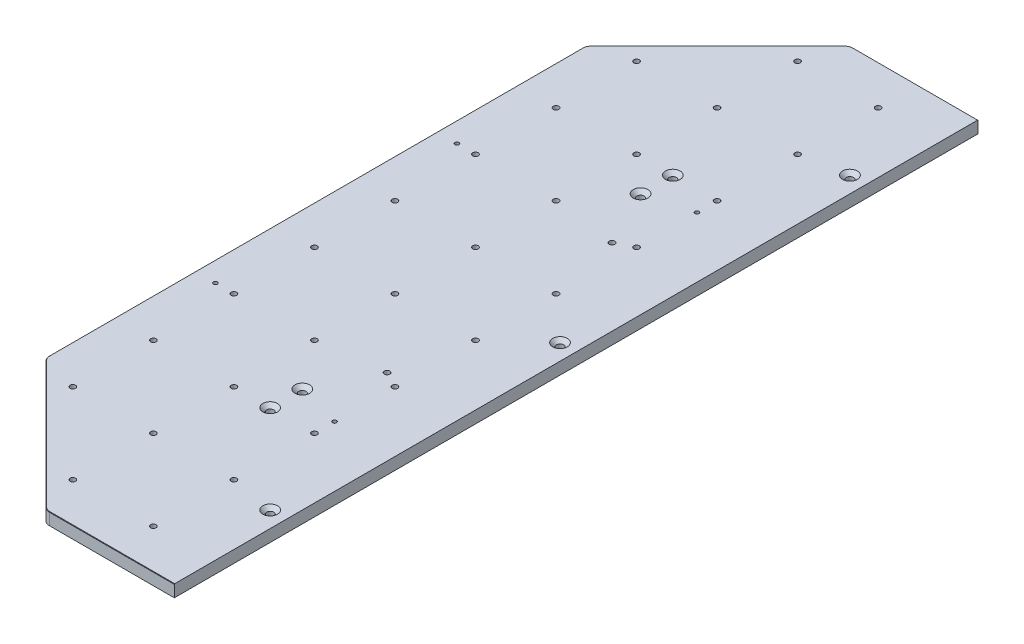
ISO-10303-21;
HEADER;
FILE_DESCRIPTION(('STEP AP214'),'2;1');
FILE_NAME('part.step','',(''),(''),'','','');
FILE_SCHEMA(('AUTOMOTIVE_DESIGN { 1 0 10303 214 1 1 1 1 }'));
ENDSEC;
DATA;
#1=APPLICATION_CONTEXT('core data for automotive mechanical design processes');
#2=APPLICATION_PROTOCOL_DEFINITION('international standard','automotive_design',2000,#1);
#3=PRODUCT_CONTEXT('',#1,'mechanical');
#4=PRODUCT('Part','Part','',(#3));
#5=PRODUCT_RELATED_PRODUCT_CATEGORY('part','',(#4));
#6=PRODUCT_DEFINITION_FORMATION('','',#4);
#7=PRODUCT_DEFINITION_CONTEXT('part definition',#1,'design');
#8=PRODUCT_DEFINITION('design','',#6,#7);
#9=PRODUCT_DEFINITION_SHAPE('','',#8);
#10=(LENGTH_UNIT() NAMED_UNIT(*) SI_UNIT(.MILLI.,.METRE.));
#11=(NAMED_UNIT(*) PLANE_ANGLE_UNIT() SI_UNIT($,.RADIAN.));
#12=(NAMED_UNIT(*) SI_UNIT($,.STERADIAN.) SOLID_ANGLE_UNIT());
#13=UNCERTAINTY_MEASURE_WITH_UNIT(LENGTH_MEASURE(1.E-05),#10,'distance_accuracy_value','');
#14=(GEOMETRIC_REPRESENTATION_CONTEXT(3) GLOBAL_UNCERTAINTY_ASSIGNED_CONTEXT((#13)) GLOBAL_UNIT_ASSIGNED_CONTEXT((#10,
#11,#12)) REPRESENTATION_CONTEXT('',''));
#15=CARTESIAN_POINT('',(0.,0.,0.));
#16=DIRECTION('',(0.,0.,1.));
#17=DIRECTION('',(1.,0.,0.));
#18=AXIS2_PLACEMENT_3D('',#15,#16,#17);
#19=CARTESIAN_POINT('',(-425.,0.,0.));
#20=DIRECTION('',(1.,0.,0.));
#21=DIRECTION('',(0.,0.,-1.));
#22=AXIS2_PLACEMENT_3D('',#19,#20,#21);
#23=PLANE('',#22);
#24=DIRECTION('',(0.,0.707106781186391,-0.707106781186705));
#25=VECTOR('',#24,1.);
#26=CARTESIAN_POINT('',(-425.,15.,498.5));
#27=LINE('',#26,#25);
#28=CARTESIAN_POINT('',(-425.,14.5000000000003,499.));
#29=VERTEX_POINT('',#28);
#30=CARTESIAN_POINT('',(-425.,15.,498.5));
#31=VERTEX_POINT('',#30);
#32=EDGE_CURVE('E167',#29,#31,#27,.T.);
#33=ORIENTED_EDGE('',*,*,#32,.F.);
#34=DIRECTION('',(0.,-1.,0.));
#35=VECTOR('',#34,1.);
#36=CARTESIAN_POINT('',(-425.,15.,499.));
#37=LINE('',#36,#35);
#38=CARTESIAN_POINT('',(-425.,0.,499.));
#39=VERTEX_POINT('',#38);
#40=EDGE_CURVE('E153',#29,#39,#37,.T.);
#41=ORIENTED_EDGE('',*,*,#40,.T.);
#42=DIRECTION('',(0.,0.,-1.));
#43=VECTOR('',#42,1.);
#44=CARTESIAN_POINT('',(-425.,0.,0.));
#45=LINE('',#44,#43);
#46=CARTESIAN_POINT('',(-425.,0.,-499.));
#47=VERTEX_POINT('',#46);
#48=EDGE_CURVE('E165',#39,#47,#45,.T.);
#49=ORIENTED_EDGE('',*,*,#48,.T.);
#50=DIRECTION('',(0.,1.,0.));
#51=VECTOR('',#50,1.);
#52=CARTESIAN_POINT('',(-425.,15.,-499.));
#53=LINE('',#52,#51);
#54=CARTESIAN_POINT('',(-425.,14.5000000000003,-499.));
#55=VERTEX_POINT('',#54);
#56=EDGE_CURVE('E168',#47,#55,#53,.T.);
#57=ORIENTED_EDGE('',*,*,#56,.T.);
#58=DIRECTION('',(0.,-0.707106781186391,-0.707106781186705));
#59=VECTOR('',#58,1.);
#60=CARTESIAN_POINT('',(-425.,15.,-498.5));
#61=LINE('',#60,#59);
#62=CARTESIAN_POINT('',(-425.,15.,-498.5));
#63=VERTEX_POINT('',#62);
#64=EDGE_CURVE('E492',#63,#55,#61,.T.);
#65=ORIENTED_EDGE('',*,*,#64,.F.);
#66=DIRECTION('',(0.,0.,-1.));
#67=VECTOR('',#66,1.);
#68=CARTESIAN_POINT('',(-425.,15.,0.));
#69=LINE('',#68,#67);
#70=EDGE_CURVE('E495',#31,#63,#69,.T.);
#71=ORIENTED_EDGE('',*,*,#70,.F.);
#72=EDGE_LOOP('',(#33,#41,#49,#57,#65,#71));
#73=FACE_BOUND('',#72,.T.);
#74=ADVANCED_FACE('F41',(#73),#23,.T.);
#75=CARTESIAN_POINT('',(-500.,7.,225.));
#76=DIRECTION('',(0.,1.,0.));
#77=DIRECTION('',(0.,0.,1.));
#78=AXIS2_PLACEMENT_3D('',#75,#76,#77);
#79=CONICAL_SURFACE('',#78,2.5,1.02974425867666);
#80=CARTESIAN_POINT('',(-500.,5.4978484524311,225.));
#81=VERTEX_POINT('',#80);
#82=VERTEX_LOOP('',#81);
#83=FACE_BOUND('',#82,.T.);
#84=CARTESIAN_POINT('',(-500.,7.,225.));
#85=DIRECTION('',(0.,1.,0.));
#86=DIRECTION('',(0.,0.,1.));
#87=AXIS2_PLACEMENT_3D('',#84,#85,#86);
#88=CIRCLE('',#87,2.5);
#89=CARTESIAN_POINT('',(-500.,7.,227.5));
#90=VERTEX_POINT('',#89);
#91=EDGE_CURVE('E479',#90,#90,#88,.T.);
#92=ORIENTED_EDGE('',*,*,#91,.T.);
#93=EDGE_LOOP('',(#92));
#94=FACE_BOUND('',#93,.T.);
#95=ADVANCED_FACE('F600',(#83,#94),#79,.F.);
#96=CARTESIAN_POINT('',(-500.,7.,-225.));
#97=DIRECTION('',(0.,1.,0.));
#98=DIRECTION('',(0.,0.,1.));
#99=AXIS2_PLACEMENT_3D('',#96,#97,#98);
#100=CONICAL_SURFACE('',#99,2.5,1.02974425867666);
#101=CARTESIAN_POINT('',(-500.,5.4978484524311,-225.));
#102=VERTEX_POINT('',#101);
#103=VERTEX_LOOP('',#102);
#104=FACE_BOUND('',#103,.T.);
#105=CARTESIAN_POINT('',(-500.,7.,-225.));
#106=DIRECTION('',(0.,1.,0.));
#107=DIRECTION('',(0.,0.,1.));
#108=AXIS2_PLACEMENT_3D('',#105,#106,#107);
#109=CIRCLE('',#108,2.5);
#110=CARTESIAN_POINT('',(-500.,7.,-222.5));
#111=VERTEX_POINT('',#110);
#112=EDGE_CURVE('E469',#111,#111,#109,.T.);
#113=ORIENTED_EDGE('',*,*,#112,.T.);
#114=EDGE_LOOP('',(#113));
#115=FACE_BOUND('',#114,.T.);
#116=ADVANCED_FACE('F602',(#104,#115),#100,.F.);
#117=CARTESIAN_POINT('',(-748.,14.5000000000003,335.333333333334));
#118=DIRECTION('',(-0.499999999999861,0.707106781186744,0.499999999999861));
#119=DIRECTION('',(0.707106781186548,0.,0.707106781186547));
#120=AXIS2_PLACEMENT_3D('',#117,#118,#119);
#121=PLANE('',#120);
#122=DIRECTION('',(0.500000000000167,0.707106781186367,-0.500000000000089));
#123=VECTOR('',#122,1.);
#124=CARTESIAN_POINT('',(-587.262265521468,14.5000000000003,496.071067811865));
#125=LINE('',#124,#123);
#126=CARTESIAN_POINT('',(-587.262265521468,14.5000000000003,496.071067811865));
#127=VERTEX_POINT('',#126);
#128=CARTESIAN_POINT('',(-586.908712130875,15.,495.717514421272));
#129=VERTEX_POINT('',#128);
#130=EDGE_CURVE('E536',#127,#129,#125,.T.);
#131=ORIENTED_EDGE('',*,*,#130,.T.);
#132=DIRECTION('',(0.707106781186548,0.,0.707106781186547));
#133=VECTOR('',#132,1.);
#134=CARTESIAN_POINT('',(-586.908712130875,15.,495.717514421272));
#135=LINE('',#134,#133);
#136=CARTESIAN_POINT('',(-744.717514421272,15.,337.908712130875));
#137=VERTEX_POINT('',#136);
#138=EDGE_CURVE('E198',#137,#129,#135,.T.);
#139=ORIENTED_EDGE('',*,*,#138,.F.);
#140=DIRECTION('',(0.500000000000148,0.707106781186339,-0.500000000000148));
#141=VECTOR('',#140,1.);
#142=CARTESIAN_POINT('',(-745.071067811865,14.5000000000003,338.262265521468));
#143=LINE('',#142,#141);
#144=CARTESIAN_POINT('',(-745.071067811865,14.5000000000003,338.262265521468));
#145=VERTEX_POINT('',#144);
#146=EDGE_CURVE('E533',#145,#137,#143,.T.);
#147=ORIENTED_EDGE('',*,*,#146,.F.);
#148=DIRECTION('',(-0.707106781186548,0.,-0.707106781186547));
#149=VECTOR('',#148,1.);
#150=CARTESIAN_POINT('',(-745.071067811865,14.5000000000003,338.262265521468));
#151=LINE('',#150,#149);
#152=EDGE_CURVE('E554',#127,#145,#151,.T.);
#153=ORIENTED_EDGE('',*,*,#152,.F.);
#154=EDGE_LOOP('',(#131,#139,#147,#153));
#155=FACE_BOUND('',#154,.T.);
#156=ADVANCED_FACE('F531',(#155),#121,.T.);
#157=CARTESIAN_POINT('',(-738.,15.,331.191197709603));
#158=DIRECTION('',(0.,-1.,0.));
#159=DIRECTION('',(0.,0.,-1.));
#160=AXIS2_PLACEMENT_3D('',#157,#158,#159);
#161=CONICAL_SURFACE('',#160,9.50000000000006,0.785398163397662);
#162=ORIENTED_EDGE('',*,*,#146,.T.);
#163=CARTESIAN_POINT('',(-738.,15.,331.191197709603));
#164=DIRECTION('',(0.,1.,0.));
#165=DIRECTION('',(0.,0.,1.));
#166=AXIS2_PLACEMENT_3D('',#163,#164,#165);
#167=CIRCLE('',#166,9.50000000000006);
#168=CARTESIAN_POINT('',(-747.5,15.,331.191197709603));
#169=VERTEX_POINT('',#168);
#170=EDGE_CURVE('E201',#169,#137,#167,.T.);
#171=ORIENTED_EDGE('',*,*,#170,.F.);
#172=DIRECTION('',(0.707106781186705,0.707106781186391,0.));
#173=VECTOR('',#172,1.);
#174=CARTESIAN_POINT('',(-748.,14.5000000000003,331.191197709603));
#175=LINE('',#174,#173);
#176=CARTESIAN_POINT('',(-748.,14.5000000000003,331.191197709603));
#177=VERTEX_POINT('',#176);
#178=EDGE_CURVE('E539',#177,#169,#175,.T.);
#179=ORIENTED_EDGE('',*,*,#178,.F.);
#180=CARTESIAN_POINT('',(-738.,14.5000000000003,331.191197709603));
#181=DIRECTION('',(0.,1.,0.));
#182=DIRECTION('',(0.,0.,1.));
#183=AXIS2_PLACEMENT_3D('',#180,#181,#182);
#184=CIRCLE('',#183,10.);
#185=EDGE_CURVE('E538',#145,#177,#184,.F.);
#186=ORIENTED_EDGE('',*,*,#185,.F.);
#187=EDGE_LOOP('',(#162,#171,#179,#186));
#188=FACE_BOUND('',#187,.T.);
#189=ADVANCED_FACE('F537',(#188),#161,.T.);
#190=CARTESIAN_POINT('',(-747.5,15.,0.));
#191=DIRECTION('',(-0.707106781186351,0.707106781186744,0.));
#192=DIRECTION('',(0.,0.,-1.));
#193=AXIS2_PLACEMENT_3D('',#190,#191,#192);
#194=PLANE('',#193);
#195=ORIENTED_EDGE('',*,*,#178,.T.);
#196=DIRECTION('',(0.,0.,1.));
#197=VECTOR('',#196,1.);
#198=CARTESIAN_POINT('',(-747.5,15.,331.191197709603));
#199=LINE('',#198,#197);
#200=CARTESIAN_POINT('',(-747.5,15.,-331.191197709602));
#201=VERTEX_POINT('',#200);
#202=EDGE_CURVE('E520',#201,#169,#199,.T.);
#203=ORIENTED_EDGE('',*,*,#202,.F.);
#204=DIRECTION('',(0.707106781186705,0.707106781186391,0.));
#205=VECTOR('',#204,1.);
#206=CARTESIAN_POINT('',(-748.,14.5000000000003,-331.191197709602));
#207=LINE('',#206,#205);
#208=CARTESIAN_POINT('',(-748.,14.5000000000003,-331.191197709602));
#209=VERTEX_POINT('',#208);
#210=EDGE_CURVE('E541',#209,#201,#207,.T.);
#211=ORIENTED_EDGE('',*,*,#210,.F.);
#212=DIRECTION('',(0.,0.,-1.));
#213=VECTOR('',#212,1.);
#214=CARTESIAN_POINT('',(-748.,14.5000000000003,-331.191197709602));
#215=LINE('',#214,#213);
#216=EDGE_CURVE('E557',#177,#209,#215,.T.);
#217=ORIENTED_EDGE('',*,*,#216,.F.);
#218=EDGE_LOOP('',(#195,#203,#211,#217));
#219=FACE_BOUND('',#218,.T.);
#220=ADVANCED_FACE('F578',(#219),#194,.T.);
#221=CARTESIAN_POINT('',(-738.,15.,-331.191197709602));
#222=DIRECTION('',(0.,-1.,0.));
#223=DIRECTION('',(0.,0.,-1.));
#224=AXIS2_PLACEMENT_3D('',#221,#222,#223);
#225=CONICAL_SURFACE('',#224,9.50000000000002,0.785398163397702);
#226=ORIENTED_EDGE('',*,*,#210,.T.);
#227=CARTESIAN_POINT('',(-738.,15.,-331.191197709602));
#228=DIRECTION('',(0.,1.,0.));
#229=DIRECTION('',(0.,0.,1.));
#230=AXIS2_PLACEMENT_3D('',#227,#228,#229);
#231=CIRCLE('',#230,9.50000000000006);
#232=CARTESIAN_POINT('',(-744.717514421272,15.,-337.908712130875));
#233=VERTEX_POINT('',#232);
#234=EDGE_CURVE('E514',#233,#201,#231,.T.);
#235=ORIENTED_EDGE('',*,*,#234,.F.);
#236=DIRECTION('',(0.500000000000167,0.707106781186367,0.500000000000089));
#237=VECTOR('',#236,1.);
#238=CARTESIAN_POINT('',(-745.071067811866,14.5000000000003,-338.262265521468));
#239=LINE('',#238,#237);
#240=CARTESIAN_POINT('',(-745.071067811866,14.5000000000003,-338.262265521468));
#241=VERTEX_POINT('',#240);
#242=EDGE_CURVE('E548',#241,#233,#239,.T.);
#243=ORIENTED_EDGE('',*,*,#242,.F.);
#244=CARTESIAN_POINT('',(-738.,14.5000000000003,-331.191197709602));
#245=DIRECTION('',(0.,1.,0.));
#246=DIRECTION('',(0.,0.,1.));
#247=AXIS2_PLACEMENT_3D('',#244,#245,#246);
#248=CIRCLE('',#247,10.);
#249=EDGE_CURVE('E559',#209,#241,#248,.F.);
#250=ORIENTED_EDGE('',*,*,#249,.F.);
#251=EDGE_LOOP('',(#226,#235,#243,#250));
#252=FACE_BOUND('',#251,.T.);
#253=ADVANCED_FACE('F573',(#252),#225,.T.);
#254=CARTESIAN_POINT('',(-748.,14.5000000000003,-335.333333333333));
#255=DIRECTION('',(-0.499999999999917,0.707106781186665,-0.499999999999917));
#256=DIRECTION('',(-0.707106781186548,0.,0.707106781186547));
#257=AXIS2_PLACEMENT_3D('',#254,#255,#256);
#258=PLANE('',#257);
#259=ORIENTED_EDGE('',*,*,#242,.T.);
#260=DIRECTION('',(-0.707106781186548,0.,0.707106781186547));
#261=VECTOR('',#260,1.);
#262=CARTESIAN_POINT('',(-744.717514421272,15.,-337.908712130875));
#263=LINE('',#262,#261);
#264=CARTESIAN_POINT('',(-586.908712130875,15.,-495.717514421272));
#265=VERTEX_POINT('',#264);
#266=EDGE_CURVE('E512',#265,#233,#263,.T.);
#267=ORIENTED_EDGE('',*,*,#266,.F.);
#268=DIRECTION('',(0.500000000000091,0.707106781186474,0.500000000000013));
#269=VECTOR('',#268,1.);
#270=CARTESIAN_POINT('',(-587.262265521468,14.5000000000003,-496.071067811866));
#271=LINE('',#270,#269);
#272=CARTESIAN_POINT('',(-587.262265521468,14.5000000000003,-496.071067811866));
#273=VERTEX_POINT('',#272);
#274=EDGE_CURVE('E50',#273,#265,#271,.T.);
#275=ORIENTED_EDGE('',*,*,#274,.F.);
#276=DIRECTION('',(0.707106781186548,0.,-0.707106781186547));
#277=VECTOR('',#276,1.);
#278=CARTESIAN_POINT('',(-587.262265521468,14.5000000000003,-496.071067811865));
#279=LINE('',#278,#277);
#280=EDGE_CURVE('E560',#241,#273,#279,.T.);
#281=ORIENTED_EDGE('',*,*,#280,.F.);
#282=EDGE_LOOP('',(#259,#267,#275,#281));
#283=FACE_BOUND('',#282,.T.);
#284=ADVANCED_FACE('F569',(#283),#258,.T.);
#285=CARTESIAN_POINT('',(-500.,15.,225.));
#286=DIRECTION('',(0.,1.,0.));
#287=DIRECTION('',(0.,0.,1.));
#288=AXIS2_PLACEMENT_3D('',#285,#286,#287);
#289=CYLINDRICAL_SURFACE('',#288,2.5);
#290=ORIENTED_EDGE('',*,*,#91,.F.);
#291=EDGE_LOOP('',(#290));
#292=FACE_BOUND('',#291,.T.);
#293=CARTESIAN_POINT('',(-500.,15.,225.));
#294=DIRECTION('',(0.,1.,0.));
#295=DIRECTION('',(0.,0.,1.));
#296=AXIS2_PLACEMENT_3D('',#293,#294,#295);
#297=CIRCLE('',#296,2.5);
#298=CARTESIAN_POINT('',(-500.,15.,227.5));
#299=VERTEX_POINT('',#298);
#300=EDGE_CURVE('E482',#299,#299,#297,.T.);
#301=ORIENTED_EDGE('',*,*,#300,.T.);
#302=EDGE_LOOP('',(#301));
#303=FACE_BOUND('',#302,.T.);
#304=ADVANCED_FACE('F614',(#292,#303),#289,.F.);
#305=CARTESIAN_POINT('',(-500.,15.,-225.));
#306=DIRECTION('',(0.,1.,0.));
#307=DIRECTION('',(0.,0.,1.));
#308=AXIS2_PLACEMENT_3D('',#305,#306,#307);
#309=CYLINDRICAL_SURFACE('',#308,2.5);
#310=ORIENTED_EDGE('',*,*,#112,.F.);
#311=EDGE_LOOP('',(#310));
#312=FACE_BOUND('',#311,.T.);
#313=CARTESIAN_POINT('',(-500.,15.,-225.));
#314=DIRECTION('',(0.,1.,0.));
#315=DIRECTION('',(0.,0.,1.));
#316=AXIS2_PLACEMENT_3D('',#313,#314,#315);
#317=CIRCLE('',#316,2.5);
#318=CARTESIAN_POINT('',(-500.,15.,-222.5));
#319=VERTEX_POINT('',#318);
#320=EDGE_CURVE('E476',#319,#319,#317,.T.);
#321=ORIENTED_EDGE('',*,*,#320,.T.);
#322=EDGE_LOOP('',(#321));
#323=FACE_BOUND('',#322,.T.);
#324=ADVANCED_FACE('F613',(#312,#323),#309,.F.);
#325=CARTESIAN_POINT('',(-445.,15.,-360.));
#326=DIRECTION('',(0.,1.,0.));
#327=DIRECTION('',(0.,0.,1.));
#328=AXIS2_PLACEMENT_3D('',#325,#326,#327);
#329=CONICAL_SURFACE('',#328,9.12499999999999,0.785398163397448);
#330=CARTESIAN_POINT('',(-445.,10.375,-360.));
#331=DIRECTION('',(0.,1.,0.));
#332=DIRECTION('',(0.,0.,1.));
#333=AXIS2_PLACEMENT_3D('',#330,#331,#332);
#334=CIRCLE('',#333,4.5);
#335=CARTESIAN_POINT('',(-445.,10.375,-355.5));
#336=VERTEX_POINT('',#335);
#337=EDGE_CURVE('E287',#336,#336,#334,.T.);
#338=ORIENTED_EDGE('',*,*,#337,.F.);
#339=EDGE_LOOP('',(#338));
#340=FACE_BOUND('',#339,.T.);
#341=CARTESIAN_POINT('',(-445.,15.,-360.));
#342=DIRECTION('',(0.,1.,0.));
#343=DIRECTION('',(0.,0.,1.));
#344=AXIS2_PLACEMENT_3D('',#341,#342,#343);
#345=CIRCLE('',#344,9.12499999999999);
#346=CARTESIAN_POINT('',(-445.,15.,-350.875));
#347=VERTEX_POINT('',#346);
#348=EDGE_CURVE('E290',#347,#347,#345,.T.);
#349=ORIENTED_EDGE('',*,*,#348,.T.);
#350=EDGE_LOOP('',(#349));
#351=FACE_BOUND('',#350,.T.);
#352=ADVANCED_FACE('F736',(#340,#351),#329,.F.);
#353=CARTESIAN_POINT('',(-445.,15.,360.));
#354=DIRECTION('',(0.,1.,0.));
#355=DIRECTION('',(0.,0.,1.));
#356=AXIS2_PLACEMENT_3D('',#353,#354,#355);
#357=CONICAL_SURFACE('',#356,9.12499999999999,0.785398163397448);
#358=CARTESIAN_POINT('',(-445.,10.375,360.));
#359=DIRECTION('',(0.,1.,0.));
#360=DIRECTION('',(0.,0.,1.));
#361=AXIS2_PLACEMENT_3D('',#358,#359,#360);
#362=CIRCLE('',#361,4.5);
#363=CARTESIAN_POINT('',(-445.,10.375,364.5));
#364=VERTEX_POINT('',#363);
#365=EDGE_CURVE('E278',#364,#364,#362,.T.);
#366=ORIENTED_EDGE('',*,*,#365,.F.);
#367=EDGE_LOOP('',(#366));
#368=FACE_BOUND('',#367,.T.);
#369=CARTESIAN_POINT('',(-445.,15.,360.));
#370=DIRECTION('',(0.,1.,0.));
#371=DIRECTION('',(0.,0.,1.));
#372=AXIS2_PLACEMENT_3D('',#369,#370,#371);
#373=CIRCLE('',#372,9.12499999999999);
#374=CARTESIAN_POINT('',(-445.,15.,369.125));
#375=VERTEX_POINT('',#374);
#376=EDGE_CURVE('E281',#375,#375,#373,.T.);
#377=ORIENTED_EDGE('',*,*,#376,.T.);
#378=EDGE_LOOP('',(#377));
#379=FACE_BOUND('',#378,.T.);
#380=ADVANCED_FACE('F741',(#368,#379),#357,.F.);
#381=CARTESIAN_POINT('',(-555.,15.,-210.));
#382=DIRECTION('',(0.,1.,0.));
#383=DIRECTION('',(0.,0.,1.));
#384=AXIS2_PLACEMENT_3D('',#381,#382,#383);
#385=CONICAL_SURFACE('',#384,9.12500000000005,0.78539816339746);
#386=CARTESIAN_POINT('',(-555.,10.375,-210.));
#387=DIRECTION('',(0.,1.,0.));
#388=DIRECTION('',(0.,0.,1.));
#389=AXIS2_PLACEMENT_3D('',#386,#387,#388);
#390=CIRCLE('',#389,4.49999999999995);
#391=CARTESIAN_POINT('',(-555.,10.375,-205.5));
#392=VERTEX_POINT('',#391);
#393=EDGE_CURVE('E269',#392,#392,#390,.T.);
#394=ORIENTED_EDGE('',*,*,#393,.F.);
#395=EDGE_LOOP('',(#394));
#396=FACE_BOUND('',#395,.T.);
#397=CARTESIAN_POINT('',(-555.,15.,-210.));
#398=DIRECTION('',(0.,1.,0.));
#399=DIRECTION('',(0.,0.,1.));
#400=AXIS2_PLACEMENT_3D('',#397,#398,#399);
#401=CIRCLE('',#400,9.12500000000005);
#402=CARTESIAN_POINT('',(-555.,15.,-200.875));
#403=VERTEX_POINT('',#402);
#404=EDGE_CURVE('E272',#403,#403,#401,.T.);
#405=ORIENTED_EDGE('',*,*,#404,.T.);
#406=EDGE_LOOP('',(#405));
#407=FACE_BOUND('',#406,.T.);
#408=ADVANCED_FACE('F749',(#396,#407),#385,.F.);
#409=CARTESIAN_POINT('',(-555.,15.,210.));
#410=DIRECTION('',(0.,1.,0.));
#411=DIRECTION('',(0.,0.,1.));
#412=AXIS2_PLACEMENT_3D('',#409,#410,#411);
#413=CONICAL_SURFACE('',#412,9.12500000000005,0.78539816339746);
#414=CARTESIAN_POINT('',(-555.,10.375,210.));
#415=DIRECTION('',(0.,1.,0.));
#416=DIRECTION('',(0.,0.,1.));
#417=AXIS2_PLACEMENT_3D('',#414,#415,#416);
#418=CIRCLE('',#417,4.49999999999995);
#419=CARTESIAN_POINT('',(-555.,10.375,214.5));
#420=VERTEX_POINT('',#419);
#421=EDGE_CURVE('E260',#420,#420,#418,.T.);
#422=ORIENTED_EDGE('',*,*,#421,.F.);
#423=EDGE_LOOP('',(#422));
#424=FACE_BOUND('',#423,.T.);
#425=CARTESIAN_POINT('',(-555.,15.,210.));
#426=DIRECTION('',(0.,1.,0.));
#427=DIRECTION('',(0.,0.,1.));
#428=AXIS2_PLACEMENT_3D('',#425,#426,#427);
#429=CIRCLE('',#428,9.12500000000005);
#430=CARTESIAN_POINT('',(-555.,15.,219.125));
#431=VERTEX_POINT('',#430);
#432=EDGE_CURVE('E263',#431,#431,#429,.T.);
#433=ORIENTED_EDGE('',*,*,#432,.T.);
#434=EDGE_LOOP('',(#433));
#435=FACE_BOUND('',#434,.T.);
#436=ADVANCED_FACE('F1170',(#424,#435),#413,.F.);
#437=CARTESIAN_POINT('',(-555.,15.,-250.));
#438=DIRECTION('',(0.,1.,0.));
#439=DIRECTION('',(0.,0.,1.));
#440=AXIS2_PLACEMENT_3D('',#437,#438,#439);
#441=CONICAL_SURFACE('',#440,9.12500000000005,0.78539816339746);
#442=CARTESIAN_POINT('',(-555.,10.375,-250.));
#443=DIRECTION('',(0.,1.,0.));
#444=DIRECTION('',(0.,0.,1.));
#445=AXIS2_PLACEMENT_3D('',#442,#443,#444);
#446=CIRCLE('',#445,4.49999999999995);
#447=CARTESIAN_POINT('',(-555.,10.375,-245.5));
#448=VERTEX_POINT('',#447);
#449=EDGE_CURVE('E251',#448,#448,#446,.T.);
#450=ORIENTED_EDGE('',*,*,#449,.F.);
#451=EDGE_LOOP('',(#450));
#452=FACE_BOUND('',#451,.T.);
#453=CARTESIAN_POINT('',(-555.,15.,-250.));
#454=DIRECTION('',(0.,1.,0.));
#455=DIRECTION('',(0.,0.,1.));
#456=AXIS2_PLACEMENT_3D('',#453,#454,#455);
#457=CIRCLE('',#456,9.12500000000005);
#458=CARTESIAN_POINT('',(-555.,15.,-240.875));
#459=VERTEX_POINT('',#458);
#460=EDGE_CURVE('E254',#459,#459,#457,.T.);
#461=ORIENTED_EDGE('',*,*,#460,.T.);
#462=EDGE_LOOP('',(#461));
#463=FACE_BOUND('',#462,.T.);
#464=ADVANCED_FACE('F1166',(#452,#463),#441,.F.);
#465=CARTESIAN_POINT('',(-555.,15.,250.));
#466=DIRECTION('',(0.,1.,0.));
#467=DIRECTION('',(0.,0.,1.));
#468=AXIS2_PLACEMENT_3D('',#465,#466,#467);
#469=CONICAL_SURFACE('',#468,9.12500000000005,0.78539816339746);
#470=CARTESIAN_POINT('',(-555.,10.375,250.));
#471=DIRECTION('',(0.,1.,0.));
#472=DIRECTION('',(0.,0.,1.));
#473=AXIS2_PLACEMENT_3D('',#470,#471,#472);
#474=CIRCLE('',#473,4.49999999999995);
#475=CARTESIAN_POINT('',(-555.,10.375,254.5));
#476=VERTEX_POINT('',#475);
#477=EDGE_CURVE('E242',#476,#476,#474,.T.);
#478=ORIENTED_EDGE('',*,*,#477,.F.);
#479=EDGE_LOOP('',(#478));
#480=FACE_BOUND('',#479,.T.);
#481=CARTESIAN_POINT('',(-555.,15.,250.));
#482=DIRECTION('',(0.,1.,0.));
#483=DIRECTION('',(0.,0.,1.));
#484=AXIS2_PLACEMENT_3D('',#481,#482,#483);
#485=CIRCLE('',#484,9.12500000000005);
#486=CARTESIAN_POINT('',(-555.,15.,259.125));
#487=VERTEX_POINT('',#486);
#488=EDGE_CURVE('E245',#487,#487,#485,.T.);
#489=ORIENTED_EDGE('',*,*,#488,.T.);
#490=EDGE_LOOP('',(#489));
#491=FACE_BOUND('',#490,.T.);
#492=ADVANCED_FACE('F1162',(#480,#491),#469,.F.);
#493=CARTESIAN_POINT('',(-445.,15.,1.11022302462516E-13));
#494=DIRECTION('',(0.,1.,0.));
#495=DIRECTION('',(0.,0.,1.));
#496=AXIS2_PLACEMENT_3D('',#493,#494,#495);
#497=CONICAL_SURFACE('',#496,9.12499999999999,0.785398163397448);
#498=CARTESIAN_POINT('',(-445.,10.375,1.11022302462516E-13));
#499=DIRECTION('',(0.,1.,0.));
#500=DIRECTION('',(0.,0.,1.));
#501=AXIS2_PLACEMENT_3D('',#498,#499,#500);
#502=CIRCLE('',#501,4.5);
#503=CARTESIAN_POINT('',(-445.,10.375,4.50000000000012));
#504=VERTEX_POINT('',#503);
#505=EDGE_CURVE('E233',#504,#504,#502,.T.);
#506=ORIENTED_EDGE('',*,*,#505,.F.);
#507=EDGE_LOOP('',(#506));
#508=FACE_BOUND('',#507,.T.);
#509=CARTESIAN_POINT('',(-445.,15.,1.11022302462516E-13));
#510=DIRECTION('',(0.,1.,0.));
#511=DIRECTION('',(0.,0.,1.));
#512=AXIS2_PLACEMENT_3D('',#509,#510,#511);
#513=CIRCLE('',#512,9.12499999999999);
#514=CARTESIAN_POINT('',(-445.,15.,9.1250000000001));
#515=VERTEX_POINT('',#514);
#516=EDGE_CURVE('E236',#515,#515,#513,.T.);
#517=ORIENTED_EDGE('',*,*,#516,.T.);
#518=EDGE_LOOP('',(#517));
#519=FACE_BOUND('',#518,.T.);
#520=ADVANCED_FACE('F596',(#508,#519),#497,.F.);
#521=CARTESIAN_POINT('',(-580.191197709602,15.,-489.));
#522=DIRECTION('',(0.,1.,0.));
#523=DIRECTION('',(0.,0.,1.));
#524=AXIS2_PLACEMENT_3D('',#521,#522,#523);
#525=CYLINDRICAL_SURFACE('',#524,10.);
#526=DIRECTION('',(0.,1.,0.));
#527=VECTOR('',#526,1.);
#528=CARTESIAN_POINT('',(-587.262265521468,0.,-496.071067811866));
#529=LINE('',#528,#527);
#530=CARTESIAN_POINT('',(-587.262265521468,0.,-496.071067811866));
#531=VERTEX_POINT('',#530);
#532=EDGE_CURVE('E212',#273,#531,#529,.F.);
#533=ORIENTED_EDGE('',*,*,#532,.F.);
#534=CARTESIAN_POINT('',(-580.191197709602,14.5000000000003,-489.));
#535=DIRECTION('',(0.,1.,0.));
#536=DIRECTION('',(0.,0.,1.));
#537=AXIS2_PLACEMENT_3D('',#534,#535,#536);
#538=CIRCLE('',#537,10.);
#539=CARTESIAN_POINT('',(-580.191197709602,14.5000000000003,-499.));
#540=VERTEX_POINT('',#539);
#541=EDGE_CURVE('E185',#273,#540,#538,.F.);
#542=ORIENTED_EDGE('',*,*,#541,.T.);
#543=DIRECTION('',(0.,1.,0.));
#544=VECTOR('',#543,1.);
#545=CARTESIAN_POINT('',(-580.191197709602,15.,-499.));
#546=LINE('',#545,#544);
#547=CARTESIAN_POINT('',(-580.191197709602,0.,-499.));
#548=VERTEX_POINT('',#547);
#549=EDGE_CURVE('E217',#548,#540,#546,.T.);
#550=ORIENTED_EDGE('',*,*,#549,.F.);
#551=CARTESIAN_POINT('',(-580.191197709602,0.,-489.));
#552=DIRECTION('',(0.,1.,0.));
#553=DIRECTION('',(0.,0.,1.));
#554=AXIS2_PLACEMENT_3D('',#551,#552,#553);
#555=CIRCLE('',#554,10.);
#556=EDGE_CURVE('E220',#531,#548,#555,.F.);
#557=ORIENTED_EDGE('',*,*,#556,.F.);
#558=EDGE_LOOP('',(#533,#542,#550,#557));
#559=FACE_BOUND('',#558,.T.);
#560=ADVANCED_FACE('F565',(#559),#525,.T.);
#561=CARTESIAN_POINT('',(-748.,0.,-335.333333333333));
#562=DIRECTION('',(0.707106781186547,0.,0.707106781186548));
#563=DIRECTION('',(0.707106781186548,0.,-0.707106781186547));
#564=AXIS2_PLACEMENT_3D('',#561,#562,#563);
#565=PLANE('',#564);
#566=DIRECTION('',(0.,1.,0.));
#567=VECTOR('',#566,1.);
#568=CARTESIAN_POINT('',(-745.071067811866,0.,-338.262265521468));
#569=LINE('',#568,#567);
#570=CARTESIAN_POINT('',(-745.071067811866,0.,-338.262265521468));
#571=VERTEX_POINT('',#570);
#572=EDGE_CURVE('E214',#571,#241,#569,.T.);
#573=ORIENTED_EDGE('',*,*,#572,.T.);
#574=ORIENTED_EDGE('',*,*,#280,.T.);
#575=ORIENTED_EDGE('',*,*,#532,.T.);
#576=DIRECTION('',(0.707106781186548,0.,-0.707106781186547));
#577=VECTOR('',#576,1.);
#578=CARTESIAN_POINT('',(-748.,0.,-335.333333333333));
#579=LINE('',#578,#577);
#580=EDGE_CURVE('E488',#571,#531,#579,.T.);
#581=ORIENTED_EDGE('',*,*,#580,.F.);
#582=EDGE_LOOP('',(#573,#574,#575,#581));
#583=FACE_BOUND('',#582,.T.);
#584=ADVANCED_FACE('F588',(#583),#565,.F.);
#585=CARTESIAN_POINT('',(-738.,0.,-331.191197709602));
#586=DIRECTION('',(0.,1.,0.));
#587=DIRECTION('',(0.,0.,1.));
#588=AXIS2_PLACEMENT_3D('',#585,#586,#587);
#589=CYLINDRICAL_SURFACE('',#588,10.);
#590=DIRECTION('',(0.,1.,0.));
#591=VECTOR('',#590,1.);
#592=CARTESIAN_POINT('',(-748.,15.,-331.191197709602));
#593=LINE('',#592,#591);
#594=CARTESIAN_POINT('',(-748.,0.,-331.191197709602));
#595=VERTEX_POINT('',#594);
#596=EDGE_CURVE('E207',#209,#595,#593,.F.);
#597=ORIENTED_EDGE('',*,*,#596,.F.);
#598=ORIENTED_EDGE('',*,*,#249,.T.);
#599=ORIENTED_EDGE('',*,*,#572,.F.);
#600=CARTESIAN_POINT('',(-738.,0.,-331.191197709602));
#601=DIRECTION('',(0.,1.,0.));
#602=DIRECTION('',(0.,0.,1.));
#603=AXIS2_PLACEMENT_3D('',#600,#601,#602);
#604=CIRCLE('',#603,10.);
#605=EDGE_CURVE('E222',#595,#571,#604,.F.);
#606=ORIENTED_EDGE('',*,*,#605,.F.);
#607=EDGE_LOOP('',(#597,#598,#599,#606));
#608=FACE_BOUND('',#607,.T.);
#609=ADVANCED_FACE('F586',(#608),#589,.T.);
#610=CARTESIAN_POINT('',(-748.,15.,-439.));
#611=DIRECTION('',(1.,0.,0.));
#612=DIRECTION('',(0.,0.,-1.));
#613=AXIS2_PLACEMENT_3D('',#610,#611,#612);
#614=PLANE('',#613);
#615=DIRECTION('',(0.,1.,0.));
#616=VECTOR('',#615,1.);
#617=CARTESIAN_POINT('',(-748.,15.,331.191197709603));
#618=LINE('',#617,#616);
#619=CARTESIAN_POINT('',(-748.,0.,331.191197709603));
#620=VERTEX_POINT('',#619);
#621=EDGE_CURVE('E209',#620,#177,#618,.T.);
#622=ORIENTED_EDGE('',*,*,#621,.T.);
#623=ORIENTED_EDGE('',*,*,#216,.T.);
#624=ORIENTED_EDGE('',*,*,#596,.T.);
#625=DIRECTION('',(0.,0.,1.));
#626=VECTOR('',#625,1.);
#627=CARTESIAN_POINT('',(-748.,0.,-439.));
#628=LINE('',#627,#626);
#629=EDGE_CURVE('E160',#595,#620,#628,.T.);
#630=ORIENTED_EDGE('',*,*,#629,.T.);
#631=EDGE_LOOP('',(#622,#623,#624,#630));
#632=FACE_BOUND('',#631,.T.);
#633=ADVANCED_FACE('F581',(#632),#614,.F.);
#634=CARTESIAN_POINT('',(-738.,15.,331.191197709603));
#635=DIRECTION('',(0.,1.,0.));
#636=DIRECTION('',(0.,0.,1.));
#637=AXIS2_PLACEMENT_3D('',#634,#635,#636);
#638=CYLINDRICAL_SURFACE('',#637,10.);
#639=DIRECTION('',(0.,1.,0.));
#640=VECTOR('',#639,1.);
#641=CARTESIAN_POINT('',(-745.071067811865,0.,338.262265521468));
#642=LINE('',#641,#640);
#643=CARTESIAN_POINT('',(-745.071067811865,0.,338.262265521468));
#644=VERTEX_POINT('',#643);
#645=EDGE_CURVE('E191',#145,#644,#642,.F.);
#646=ORIENTED_EDGE('',*,*,#645,.F.);
#647=ORIENTED_EDGE('',*,*,#185,.T.);
#648=ORIENTED_EDGE('',*,*,#621,.F.);
#649=CARTESIAN_POINT('',(-738.,0.,331.191197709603));
#650=DIRECTION('',(0.,1.,0.));
#651=DIRECTION('',(0.,0.,1.));
#652=AXIS2_PLACEMENT_3D('',#649,#650,#651);
#653=CIRCLE('',#652,10.);
#654=EDGE_CURVE('E224',#644,#620,#653,.F.);
#655=ORIENTED_EDGE('',*,*,#654,.F.);
#656=EDGE_LOOP('',(#646,#647,#648,#655));
#657=FACE_BOUND('',#656,.T.);
#658=ADVANCED_FACE('F620',(#657),#638,.T.);
#659=CARTESIAN_POINT('',(-748.,0.,335.333333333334));
#660=DIRECTION('',(0.707106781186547,0.,-0.707106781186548));
#661=DIRECTION('',(-0.707106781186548,0.,-0.707106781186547));
#662=AXIS2_PLACEMENT_3D('',#659,#660,#661);
#663=PLANE('',#662);
#664=DIRECTION('',(0.,1.,0.));
#665=VECTOR('',#664,1.);
#666=CARTESIAN_POINT('',(-587.262265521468,0.,496.071067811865));
#667=LINE('',#666,#665);
#668=CARTESIAN_POINT('',(-587.262265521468,0.,496.071067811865));
#669=VERTEX_POINT('',#668);
#670=EDGE_CURVE('E196',#669,#127,#667,.T.);
#671=ORIENTED_EDGE('',*,*,#670,.T.);
#672=ORIENTED_EDGE('',*,*,#152,.T.);
#673=ORIENTED_EDGE('',*,*,#645,.T.);
#674=DIRECTION('',(-0.707106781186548,0.,-0.707106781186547));
#675=VECTOR('',#674,1.);
#676=CARTESIAN_POINT('',(-748.,0.,335.333333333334));
#677=LINE('',#676,#675);
#678=EDGE_CURVE('E485',#669,#644,#677,.T.);
#679=ORIENTED_EDGE('',*,*,#678,.F.);
#680=EDGE_LOOP('',(#671,#672,#673,#679));
#681=FACE_BOUND('',#680,.T.);
#682=ADVANCED_FACE('F617',(#681),#663,.F.);
#683=CARTESIAN_POINT('',(-580.191197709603,0.,489.));
#684=DIRECTION('',(0.,1.,0.));
#685=DIRECTION('',(0.,0.,1.));
#686=AXIS2_PLACEMENT_3D('',#683,#684,#685);
#687=CYLINDRICAL_SURFACE('',#686,10.);
#688=DIRECTION('',(0.,1.,0.));
#689=VECTOR('',#688,1.);
#690=CARTESIAN_POINT('',(-580.191197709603,15.,499.));
#691=LINE('',#690,#689);
#692=CARTESIAN_POINT('',(-580.191197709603,14.5000000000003,499.));
#693=VERTEX_POINT('',#692);
#694=CARTESIAN_POINT('',(-580.191197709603,0.,499.));
#695=VERTEX_POINT('',#694);
#696=EDGE_CURVE('E156',#693,#695,#691,.F.);
#697=ORIENTED_EDGE('',*,*,#696,.F.);
#698=CARTESIAN_POINT('',(-580.191197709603,14.5000000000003,489.));
#699=DIRECTION('',(0.,1.,0.));
#700=DIRECTION('',(0.,0.,1.));
#701=AXIS2_PLACEMENT_3D('',#698,#699,#700);
#702=CIRCLE('',#701,10.);
#703=EDGE_CURVE('E552',#693,#127,#702,.F.);
#704=ORIENTED_EDGE('',*,*,#703,.T.);
#705=ORIENTED_EDGE('',*,*,#670,.F.);
#706=CARTESIAN_POINT('',(-580.191197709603,0.,489.));
#707=DIRECTION('',(0.,1.,0.));
#708=DIRECTION('',(0.,0.,1.));
#709=AXIS2_PLACEMENT_3D('',#706,#707,#708);
#710=CIRCLE('',#709,10.);
#711=EDGE_CURVE('E226',#695,#669,#710,.F.);
#712=ORIENTED_EDGE('',*,*,#711,.F.);
#713=EDGE_LOOP('',(#697,#704,#705,#712));
#714=FACE_BOUND('',#713,.T.);
#715=ADVANCED_FACE('F619',(#714),#687,.T.);
#716=CARTESIAN_POINT('',(-580.191197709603,15.,489.));
#717=DIRECTION('',(0.,-1.,0.));
#718=DIRECTION('',(0.,0.,-1.));
#719=AXIS2_PLACEMENT_3D('',#716,#717,#718);
#720=CONICAL_SURFACE('',#719,9.50000000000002,0.785398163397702);
#721=DIRECTION('',(0.,0.707106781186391,-0.707106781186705));
#722=VECTOR('',#721,1.);
#723=CARTESIAN_POINT('',(-580.191197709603,14.5000000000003,499.));
#724=LINE('',#723,#722);
#725=CARTESIAN_POINT('',(-580.191197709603,15.,498.5));
#726=VERTEX_POINT('',#725);
#727=EDGE_CURVE('E491',#693,#726,#724,.T.);
#728=ORIENTED_EDGE('',*,*,#727,.T.);
#729=CARTESIAN_POINT('',(-580.191197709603,15.,489.));
#730=DIRECTION('',(0.,1.,0.));
#731=DIRECTION('',(0.,0.,1.));
#732=AXIS2_PLACEMENT_3D('',#729,#730,#731);
#733=CIRCLE('',#732,9.50000000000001);
#734=EDGE_CURVE('E192',#129,#726,#733,.T.);
#735=ORIENTED_EDGE('',*,*,#734,.F.);
#736=ORIENTED_EDGE('',*,*,#130,.F.);
#737=ORIENTED_EDGE('',*,*,#703,.F.);
#738=EDGE_LOOP('',(#728,#735,#736,#737));
#739=FACE_BOUND('',#738,.T.);
#740=ADVANCED_FACE('F626',(#739),#720,.T.);
#741=CARTESIAN_POINT('',(-580.191197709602,15.,-489.));
#742=DIRECTION('',(0.,-1.,0.));
#743=DIRECTION('',(0.,0.,-1.));
#744=AXIS2_PLACEMENT_3D('',#741,#742,#743);
#745=CONICAL_SURFACE('',#744,9.50000000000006,0.785398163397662);
#746=ORIENTED_EDGE('',*,*,#274,.T.);
#747=CARTESIAN_POINT('',(-580.191197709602,15.,-489.));
#748=DIRECTION('',(0.,1.,0.));
#749=DIRECTION('',(0.,0.,1.));
#750=AXIS2_PLACEMENT_3D('',#747,#748,#749);
#751=CIRCLE('',#750,9.50000000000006);
#752=CARTESIAN_POINT('',(-580.191197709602,15.,-498.5));
#753=VERTEX_POINT('',#752);
#754=EDGE_CURVE('E187',#753,#265,#751,.T.);
#755=ORIENTED_EDGE('',*,*,#754,.F.);
#756=DIRECTION('',(0.,0.707106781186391,0.707106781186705));
#757=VECTOR('',#756,1.);
#758=CARTESIAN_POINT('',(-580.191197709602,14.5000000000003,-499.));
#759=LINE('',#758,#757);
#760=EDGE_CURVE('E12',#540,#753,#759,.T.);
#761=ORIENTED_EDGE('',*,*,#760,.F.);
#762=ORIENTED_EDGE('',*,*,#541,.F.);
#763=EDGE_LOOP('',(#746,#755,#761,#762));
#764=FACE_BOUND('',#763,.T.);
#765=ADVANCED_FACE('F509',(#764),#745,.T.);
#766=CARTESIAN_POINT('',(-688.,15.,-499.));
#767=DIRECTION('',(0.,0.,1.));
#768=DIRECTION('',(1.,0.,0.));
#769=AXIS2_PLACEMENT_3D('',#766,#767,#768);
#770=PLANE('',#769);
#771=ORIENTED_EDGE('',*,*,#56,.F.);
#772=DIRECTION('',(-1.,0.,0.));
#773=VECTOR('',#772,1.);
#774=CARTESIAN_POINT('',(-688.,0.,-499.));
#775=LINE('',#774,#773);
#776=EDGE_CURVE('E172',#47,#548,#775,.T.);
#777=ORIENTED_EDGE('',*,*,#776,.T.);
#778=ORIENTED_EDGE('',*,*,#549,.T.);
#779=DIRECTION('',(1.,0.,0.));
#780=VECTOR('',#779,1.);
#781=CARTESIAN_POINT('',(-307.1,14.5000000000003,-499.));
#782=LINE('',#781,#780);
#783=EDGE_CURVE('E181',#540,#55,#782,.T.);
#784=ORIENTED_EDGE('',*,*,#783,.T.);
#785=EDGE_LOOP('',(#771,#777,#778,#784));
#786=FACE_BOUND('',#785,.T.);
#787=ADVANCED_FACE('F498',(#786),#770,.F.);
#788=CARTESIAN_POINT('',(0.,15.,0.));
#789=DIRECTION('',(0.,1.,0.));
#790=DIRECTION('',(0.,0.,1.));
#791=AXIS2_PLACEMENT_3D('',#788,#789,#790);
#792=PLANE('',#791);
#793=CARTESIAN_POINT('',(-723.,15.,-150.));
#794=DIRECTION('',(0.,1.,0.));
#795=DIRECTION('',(0.,0.,1.));
#796=AXIS2_PLACEMENT_3D('',#793,#794,#795);
#797=CIRCLE('',#796,2.49999999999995);
#798=CARTESIAN_POINT('',(-723.,15.,-147.5));
#799=VERTEX_POINT('',#798);
#800=EDGE_CURVE('E645',#799,#799,#797,.T.);
#801=ORIENTED_EDGE('',*,*,#800,.F.);
#802=EDGE_LOOP('',(#801));
#803=FACE_BOUND('',#802,.T.);
#804=CARTESIAN_POINT('',(-723.,15.,150.));
#805=DIRECTION('',(0.,1.,0.));
#806=DIRECTION('',(0.,0.,1.));
#807=AXIS2_PLACEMENT_3D('',#804,#805,#806);
#808=CIRCLE('',#807,2.49999999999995);
#809=CARTESIAN_POINT('',(-723.,15.,152.5));
#810=VERTEX_POINT('',#809);
#811=EDGE_CURVE('E177',#810,#810,#808,.T.);
#812=ORIENTED_EDGE('',*,*,#811,.F.);
#813=EDGE_LOOP('',(#812));
#814=FACE_BOUND('',#813,.T.);
#815=ORIENTED_EDGE('',*,*,#516,.F.);
#816=EDGE_LOOP('',(#815));
#817=FACE_BOUND('',#816,.T.);
#818=ORIENTED_EDGE('',*,*,#488,.F.);
#819=EDGE_LOOP('',(#818));
#820=FACE_BOUND('',#819,.T.);
#821=ORIENTED_EDGE('',*,*,#460,.F.);
#822=EDGE_LOOP('',(#821));
#823=FACE_BOUND('',#822,.T.);
#824=ORIENTED_EDGE('',*,*,#432,.F.);
#825=EDGE_LOOP('',(#824));
#826=FACE_BOUND('',#825,.T.);
#827=ORIENTED_EDGE('',*,*,#404,.F.);
#828=EDGE_LOOP('',(#827));
#829=FACE_BOUND('',#828,.T.);
#830=ORIENTED_EDGE('',*,*,#376,.F.);
#831=EDGE_LOOP('',(#830));
#832=FACE_BOUND('',#831,.T.);
#833=ORIENTED_EDGE('',*,*,#348,.F.);
#834=EDGE_LOOP('',(#833));
#835=FACE_BOUND('',#834,.T.);
#836=CARTESIAN_POINT('',(-520.153589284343,15.,139.653589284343));
#837=DIRECTION('',(0.,1.,0.));
#838=DIRECTION('',(0.,0.,1.));
#839=AXIS2_PLACEMENT_3D('',#836,#837,#838);
#840=CIRCLE('',#839,3.39999999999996);
#841=CARTESIAN_POINT('',(-520.153589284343,15.,143.053589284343));
#842=VERTEX_POINT('',#841);
#843=EDGE_CURVE('E296',#842,#842,#840,.T.);
#844=ORIENTED_EDGE('',*,*,#843,.F.);
#845=EDGE_LOOP('',(#844));
#846=FACE_BOUND('',#845,.T.);
#847=CARTESIAN_POINT('',(-520.153589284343,15.,-139.653589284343));
#848=DIRECTION('',(0.,1.,0.));
#849=DIRECTION('',(0.,0.,1.));
#850=AXIS2_PLACEMENT_3D('',#847,#848,#849);
#851=CIRCLE('',#850,3.39999999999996);
#852=CARTESIAN_POINT('',(-520.153589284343,15.,-136.253589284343));
#853=VERTEX_POINT('',#852);
#854=EDGE_CURVE('E302',#853,#853,#851,.T.);
#855=ORIENTED_EDGE('',*,*,#854,.F.);
#856=EDGE_LOOP('',(#855));
#857=FACE_BOUND('',#856,.T.);
#858=CARTESIAN_POINT('',(-600.,15.,450.));
#859=DIRECTION('',(0.,1.,0.));
#860=DIRECTION('',(0.,0.,1.));
#861=AXIS2_PLACEMENT_3D('',#858,#859,#860);
#862=CIRCLE('',#861,3.39999999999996);
#863=CARTESIAN_POINT('',(-600.,15.,453.4));
#864=VERTEX_POINT('',#863);
#865=EDGE_CURVE('E305',#864,#864,#862,.T.);
#866=ORIENTED_EDGE('',*,*,#865,.F.);
#867=EDGE_LOOP('',(#866));
#868=FACE_BOUND('',#867,.T.);
#869=CARTESIAN_POINT('',(-500.,15.,150.));
#870=DIRECTION('',(0.,1.,0.));
#871=DIRECTION('',(0.,0.,1.));
#872=AXIS2_PLACEMENT_3D('',#869,#870,#871);
#873=CIRCLE('',#872,3.39999999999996);
#874=CARTESIAN_POINT('',(-500.,15.,153.4));
#875=VERTEX_POINT('',#874);
#876=EDGE_CURVE('E360',#875,#875,#873,.T.);
#877=ORIENTED_EDGE('',*,*,#876,.F.);
#878=EDGE_LOOP('',(#877));
#879=FACE_BOUND('',#878,.T.);
#880=CARTESIAN_POINT('',(-600.,15.,150.));
#881=DIRECTION('',(0.,1.,0.));
#882=DIRECTION('',(0.,0.,1.));
#883=AXIS2_PLACEMENT_3D('',#880,#881,#882);
#884=CIRCLE('',#883,3.39999999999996);
#885=CARTESIAN_POINT('',(-600.,15.,153.4));
#886=VERTEX_POINT('',#885);
#887=EDGE_CURVE('E359',#886,#886,#884,.T.);
#888=ORIENTED_EDGE('',*,*,#887,.F.);
#889=EDGE_LOOP('',(#888));
#890=FACE_BOUND('',#889,.T.);
#891=CARTESIAN_POINT('',(-700.,15.,150.));
#892=DIRECTION('',(0.,1.,0.));
#893=DIRECTION('',(0.,0.,1.));
#894=AXIS2_PLACEMENT_3D('',#891,#892,#893);
#895=CIRCLE('',#894,3.39999999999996);
#896=CARTESIAN_POINT('',(-700.,15.,153.4));
#897=VERTEX_POINT('',#896);
#898=EDGE_CURVE('E349',#897,#897,#895,.T.);
#899=ORIENTED_EDGE('',*,*,#898,.F.);
#900=EDGE_LOOP('',(#899));
#901=FACE_BOUND('',#900,.T.);
#902=CARTESIAN_POINT('',(-700.,15.,-49.9999999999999));
#903=DIRECTION('',(0.,1.,0.));
#904=DIRECTION('',(0.,0.,1.));
#905=AXIS2_PLACEMENT_3D('',#902,#903,#904);
#906=CIRCLE('',#905,3.39999999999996);
#907=CARTESIAN_POINT('',(-700.,15.,-46.6));
#908=VERTEX_POINT('',#907);
#909=EDGE_CURVE('E389',#908,#908,#906,.T.);
#910=ORIENTED_EDGE('',*,*,#909,.F.);
#911=EDGE_LOOP('',(#910));
#912=FACE_BOUND('',#911,.T.);
#913=CARTESIAN_POINT('',(-700.,15.,50.));
#914=DIRECTION('',(0.,1.,0.));
#915=DIRECTION('',(0.,0.,1.));
#916=AXIS2_PLACEMENT_3D('',#913,#914,#915);
#917=CIRCLE('',#916,3.39999999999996);
#918=CARTESIAN_POINT('',(-700.,15.,53.4));
#919=VERTEX_POINT('',#918);
#920=EDGE_CURVE('E367',#919,#919,#917,.T.);
#921=ORIENTED_EDGE('',*,*,#920,.F.);
#922=EDGE_LOOP('',(#921));
#923=FACE_BOUND('',#922,.T.);
#924=CARTESIAN_POINT('',(-600.,15.,50.));
#925=DIRECTION('',(0.,1.,0.));
#926=DIRECTION('',(0.,0.,1.));
#927=AXIS2_PLACEMENT_3D('',#924,#925,#926);
#928=CIRCLE('',#927,3.39999999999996);
#929=CARTESIAN_POINT('',(-600.,15.,53.4));
#930=VERTEX_POINT('',#929);
#931=EDGE_CURVE('E372',#930,#930,#928,.T.);
#932=ORIENTED_EDGE('',*,*,#931,.F.);
#933=EDGE_LOOP('',(#932));
#934=FACE_BOUND('',#933,.T.);
#935=CARTESIAN_POINT('',(-500.,15.,50.));
#936=DIRECTION('',(0.,1.,0.));
#937=DIRECTION('',(0.,0.,1.));
#938=AXIS2_PLACEMENT_3D('',#935,#936,#937);
#939=CIRCLE('',#938,3.39999999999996);
#940=CARTESIAN_POINT('',(-500.,15.,53.4));
#941=VERTEX_POINT('',#940);
#942=EDGE_CURVE('E379',#941,#941,#939,.T.);
#943=ORIENTED_EDGE('',*,*,#942,.F.);
#944=EDGE_LOOP('',(#943));
#945=FACE_BOUND('',#944,.T.);
#946=CARTESIAN_POINT('',(-500.,15.,350.));
#947=DIRECTION('',(0.,1.,0.));
#948=DIRECTION('',(0.,0.,1.));
#949=AXIS2_PLACEMENT_3D('',#946,#947,#948);
#950=CIRCLE('',#949,3.39999999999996);
#951=CARTESIAN_POINT('',(-500.,15.,353.4));
#952=VERTEX_POINT('',#951);
#953=EDGE_CURVE('E318',#952,#952,#950,.T.);
#954=ORIENTED_EDGE('',*,*,#953,.F.);
#955=EDGE_LOOP('',(#954));
#956=FACE_BOUND('',#955,.T.);
#957=CARTESIAN_POINT('',(-600.,15.,350.));
#958=DIRECTION('',(0.,1.,0.));
#959=DIRECTION('',(0.,0.,1.));
#960=AXIS2_PLACEMENT_3D('',#957,#958,#959);
#961=CIRCLE('',#960,3.39999999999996);
#962=CARTESIAN_POINT('',(-600.,15.,353.4));
#963=VERTEX_POINT('',#962);
#964=EDGE_CURVE('E326',#963,#963,#961,.T.);
#965=ORIENTED_EDGE('',*,*,#964,.F.);
#966=EDGE_LOOP('',(#965));
#967=FACE_BOUND('',#966,.T.);
#968=CARTESIAN_POINT('',(-700.,15.,350.));
#969=DIRECTION('',(0.,1.,0.));
#970=DIRECTION('',(0.,0.,1.));
#971=AXIS2_PLACEMENT_3D('',#968,#969,#970);
#972=CIRCLE('',#971,3.39999999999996);
#973=CARTESIAN_POINT('',(-700.,15.,353.4));
#974=VERTEX_POINT('',#973);
#975=EDGE_CURVE('E317',#974,#974,#972,.T.);
#976=ORIENTED_EDGE('',*,*,#975,.F.);
#977=EDGE_LOOP('',(#976));
#978=FACE_BOUND('',#977,.T.);
#979=CARTESIAN_POINT('',(-500.,15.,450.));
#980=DIRECTION('',(0.,1.,0.));
#981=DIRECTION('',(0.,0.,1.));
#982=AXIS2_PLACEMENT_3D('',#979,#980,#981);
#983=CIRCLE('',#982,3.39999999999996);
#984=CARTESIAN_POINT('',(-500.,15.,453.4));
#985=VERTEX_POINT('',#984);
#986=EDGE_CURVE('E311',#985,#985,#983,.T.);
#987=ORIENTED_EDGE('',*,*,#986,.F.);
#988=EDGE_LOOP('',(#987));
#989=FACE_BOUND('',#988,.T.);
#990=CARTESIAN_POINT('',(-500.,15.,250.));
#991=DIRECTION('',(0.,1.,0.));
#992=DIRECTION('',(0.,0.,1.));
#993=AXIS2_PLACEMENT_3D('',#990,#991,#992);
#994=CIRCLE('',#993,3.39999999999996);
#995=CARTESIAN_POINT('',(-500.,15.,253.4));
#996=VERTEX_POINT('',#995);
#997=EDGE_CURVE('E342',#996,#996,#994,.T.);
#998=ORIENTED_EDGE('',*,*,#997,.F.);
#999=EDGE_LOOP('',(#998));
#1000=FACE_BOUND('',#999,.T.);
#1001=CARTESIAN_POINT('',(-600.,15.,250.));
#1002=DIRECTION('',(0.,1.,0.));
#1003=DIRECTION('',(0.,0.,1.));
#1004=AXIS2_PLACEMENT_3D('',#1001,#1002,#1003);
#1005=CIRCLE('',#1004,3.39999999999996);
#1006=CARTESIAN_POINT('',(-600.,15.,253.4));
#1007=VERTEX_POINT('',#1006);
#1008=EDGE_CURVE('E341',#1007,#1007,#1005,.T.);
#1009=ORIENTED_EDGE('',*,*,#1008,.F.);
#1010=EDGE_LOOP('',(#1009));
#1011=FACE_BOUND('',#1010,.T.);
#1012=CARTESIAN_POINT('',(-700.,15.,250.));
#1013=DIRECTION('',(0.,1.,0.));
#1014=DIRECTION('',(0.,0.,1.));
#1015=AXIS2_PLACEMENT_3D('',#1012,#1013,#1014);
#1016=CIRCLE('',#1015,3.39999999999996);
#1017=CARTESIAN_POINT('',(-700.,15.,253.4));
#1018=VERTEX_POINT('',#1017);
#1019=EDGE_CURVE('E325',#1018,#1018,#1016,.T.);
#1020=ORIENTED_EDGE('',*,*,#1019,.F.);
#1021=EDGE_LOOP('',(#1020));
#1022=FACE_BOUND('',#1021,.T.);
#1023=CARTESIAN_POINT('',(-500.,15.,-350.));
#1024=DIRECTION('',(0.,1.,0.));
#1025=DIRECTION('',(0.,0.,1.));
#1026=AXIS2_PLACEMENT_3D('',#1023,#1024,#1025);
#1027=CIRCLE('',#1026,3.39999999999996);
#1028=CARTESIAN_POINT('',(-500.,15.,-346.6));
#1029=VERTEX_POINT('',#1028);
#1030=EDGE_CURVE('E450',#1029,#1029,#1027,.T.);
#1031=ORIENTED_EDGE('',*,*,#1030,.F.);
#1032=EDGE_LOOP('',(#1031));
#1033=FACE_BOUND('',#1032,.T.);
#1034=CARTESIAN_POINT('',(-600.,15.,-350.));
#1035=DIRECTION('',(0.,1.,0.));
#1036=DIRECTION('',(0.,0.,1.));
#1037=AXIS2_PLACEMENT_3D('',#1034,#1035,#1036);
#1038=CIRCLE('',#1037,3.39999999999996);
#1039=CARTESIAN_POINT('',(-600.,15.,-346.6));
#1040=VERTEX_POINT('',#1039);
#1041=EDGE_CURVE('E449',#1040,#1040,#1038,.T.);
#1042=ORIENTED_EDGE('',*,*,#1041,.F.);
#1043=EDGE_LOOP('',(#1042));
#1044=FACE_BOUND('',#1043,.T.);
#1045=CARTESIAN_POINT('',(-700.,15.,-350.));
#1046=DIRECTION('',(0.,1.,0.));
#1047=DIRECTION('',(0.,0.,1.));
#1048=AXIS2_PLACEMENT_3D('',#1045,#1046,#1047);
#1049=CIRCLE('',#1048,3.39999999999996);
#1050=CARTESIAN_POINT('',(-700.,15.,-346.6));
#1051=VERTEX_POINT('',#1050);
#1052=EDGE_CURVE('E443',#1051,#1051,#1049,.T.);
#1053=ORIENTED_EDGE('',*,*,#1052,.F.);
#1054=EDGE_LOOP('',(#1053));
#1055=FACE_BOUND('',#1054,.T.);
#1056=CARTESIAN_POINT('',(-600.,15.,-450.));
#1057=DIRECTION('',(0.,1.,0.));
#1058=DIRECTION('',(0.,0.,1.));
#1059=AXIS2_PLACEMENT_3D('',#1056,#1057,#1058);
#1060=CIRCLE('',#1059,3.39999999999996);
#1061=CARTESIAN_POINT('',(-600.,15.,-446.6));
#1062=VERTEX_POINT('',#1061);
#1063=EDGE_CURVE('E457',#1062,#1062,#1060,.T.);
#1064=ORIENTED_EDGE('',*,*,#1063,.F.);
#1065=EDGE_LOOP('',(#1064));
#1066=FACE_BOUND('',#1065,.T.);
#1067=CARTESIAN_POINT('',(-500.,15.,-450.));
#1068=DIRECTION('',(0.,1.,0.));
#1069=DIRECTION('',(0.,0.,1.));
#1070=AXIS2_PLACEMENT_3D('',#1067,#1068,#1069);
#1071=CIRCLE('',#1070,3.39999999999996);
#1072=CARTESIAN_POINT('',(-500.,15.,-446.6));
#1073=VERTEX_POINT('',#1072);
#1074=EDGE_CURVE('E462',#1073,#1073,#1071,.T.);
#1075=ORIENTED_EDGE('',*,*,#1074,.F.);
#1076=EDGE_LOOP('',(#1075));
#1077=FACE_BOUND('',#1076,.T.);
#1078=CARTESIAN_POINT('',(-500.,15.,-150.));
#1079=DIRECTION('',(0.,1.,0.));
#1080=DIRECTION('',(0.,0.,1.));
#1081=AXIS2_PLACEMENT_3D('',#1078,#1079,#1080);
#1082=CIRCLE('',#1081,3.39999999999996);
#1083=CARTESIAN_POINT('',(-500.,15.,-146.6));
#1084=VERTEX_POINT('',#1083);
#1085=EDGE_CURVE('E414',#1084,#1084,#1082,.T.);
#1086=ORIENTED_EDGE('',*,*,#1085,.F.);
#1087=EDGE_LOOP('',(#1086));
#1088=FACE_BOUND('',#1087,.T.);
#1089=CARTESIAN_POINT('',(-600.,15.,-150.));
#1090=DIRECTION('',(0.,1.,0.));
#1091=DIRECTION('',(0.,0.,1.));
#1092=AXIS2_PLACEMENT_3D('',#1089,#1090,#1091);
#1093=CIRCLE('',#1092,3.39999999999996);
#1094=CARTESIAN_POINT('',(-600.,15.,-146.6));
#1095=VERTEX_POINT('',#1094);
#1096=EDGE_CURVE('E413',#1095,#1095,#1093,.T.);
#1097=ORIENTED_EDGE('',*,*,#1096,.F.);
#1098=EDGE_LOOP('',(#1097));
#1099=FACE_BOUND('',#1098,.T.);
#1100=CARTESIAN_POINT('',(-700.,15.,-150.));
#1101=DIRECTION('',(0.,1.,0.));
#1102=DIRECTION('',(0.,0.,1.));
#1103=AXIS2_PLACEMENT_3D('',#1100,#1101,#1102);
#1104=CIRCLE('',#1103,3.39999999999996);
#1105=CARTESIAN_POINT('',(-700.,15.,-146.6));
#1106=VERTEX_POINT('',#1105);
#1107=EDGE_CURVE('E403',#1106,#1106,#1104,.T.);
#1108=ORIENTED_EDGE('',*,*,#1107,.F.);
#1109=EDGE_LOOP('',(#1108));
#1110=FACE_BOUND('',#1109,.T.);
#1111=CARTESIAN_POINT('',(-500.,15.,-49.9999999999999));
#1112=DIRECTION('',(0.,1.,0.));
#1113=DIRECTION('',(0.,0.,1.));
#1114=AXIS2_PLACEMENT_3D('',#1111,#1112,#1113);
#1115=CIRCLE('',#1114,3.39999999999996);
#1116=CARTESIAN_POINT('',(-500.,15.,-46.6));
#1117=VERTEX_POINT('',#1116);
#1118=EDGE_CURVE('E396',#1117,#1117,#1115,.T.);
#1119=ORIENTED_EDGE('',*,*,#1118,.F.);
#1120=EDGE_LOOP('',(#1119));
#1121=FACE_BOUND('',#1120,.T.);
#1122=CARTESIAN_POINT('',(-600.,15.,-49.9999999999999));
#1123=DIRECTION('',(0.,1.,0.));
#1124=DIRECTION('',(0.,0.,1.));
#1125=AXIS2_PLACEMENT_3D('',#1122,#1123,#1124);
#1126=CIRCLE('',#1125,3.39999999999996);
#1127=CARTESIAN_POINT('',(-600.,15.,-46.6));
#1128=VERTEX_POINT('',#1127);
#1129=EDGE_CURVE('E395',#1128,#1128,#1126,.T.);
#1130=ORIENTED_EDGE('',*,*,#1129,.F.);
#1131=EDGE_LOOP('',(#1130));
#1132=FACE_BOUND('',#1131,.T.);
#1133=CARTESIAN_POINT('',(-700.,15.,-250.));
#1134=DIRECTION('',(0.,1.,0.));
#1135=DIRECTION('',(0.,0.,1.));
#1136=AXIS2_PLACEMENT_3D('',#1133,#1134,#1135);
#1137=CIRCLE('',#1136,3.39999999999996);
#1138=CARTESIAN_POINT('',(-700.,15.,-246.6));
#1139=VERTEX_POINT('',#1138);
#1140=EDGE_CURVE('E421',#1139,#1139,#1137,.T.);
#1141=ORIENTED_EDGE('',*,*,#1140,.F.);
#1142=EDGE_LOOP('',(#1141));
#1143=FACE_BOUND('',#1142,.T.);
#1144=CARTESIAN_POINT('',(-600.,15.,-250.));
#1145=DIRECTION('',(0.,1.,0.));
#1146=DIRECTION('',(0.,0.,1.));
#1147=AXIS2_PLACEMENT_3D('',#1144,#1145,#1146);
#1148=CIRCLE('',#1147,3.39999999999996);
#1149=CARTESIAN_POINT('',(-600.,15.,-246.6));
#1150=VERTEX_POINT('',#1149);
#1151=EDGE_CURVE('E426',#1150,#1150,#1148,.T.);
#1152=ORIENTED_EDGE('',*,*,#1151,.F.);
#1153=EDGE_LOOP('',(#1152));
#1154=FACE_BOUND('',#1153,.T.);
#1155=CARTESIAN_POINT('',(-500.,15.,-250.));
#1156=DIRECTION('',(0.,1.,0.));
#1157=DIRECTION('',(0.,0.,1.));
#1158=AXIS2_PLACEMENT_3D('',#1155,#1156,#1157);
#1159=CIRCLE('',#1158,3.39999999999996);
#1160=CARTESIAN_POINT('',(-500.,15.,-246.6));
#1161=VERTEX_POINT('',#1160);
#1162=EDGE_CURVE('E433',#1161,#1161,#1159,.T.);
#1163=ORIENTED_EDGE('',*,*,#1162,.F.);
#1164=EDGE_LOOP('',(#1163));
#1165=FACE_BOUND('',#1164,.T.);
#1166=ORIENTED_EDGE('',*,*,#320,.F.);
#1167=EDGE_LOOP('',(#1166));
#1168=FACE_BOUND('',#1167,.T.);
#1169=ORIENTED_EDGE('',*,*,#300,.F.);
#1170=EDGE_LOOP('',(#1169));
#1171=FACE_BOUND('',#1170,.T.);
#1172=DIRECTION('',(1.,0.,0.));
#1173=VECTOR('',#1172,1.);
#1174=CARTESIAN_POINT('',(580.191197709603,15.,498.5));
#1175=LINE('',#1174,#1173);
#1176=EDGE_CURVE('E189',#726,#31,#1175,.T.);
#1177=ORIENTED_EDGE('',*,*,#1176,.T.);
#1178=ORIENTED_EDGE('',*,*,#70,.T.);
#1179=DIRECTION('',(-1.,0.,0.));
#1180=VECTOR('',#1179,1.);
#1181=CARTESIAN_POINT('',(-580.191197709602,15.,-498.5));
#1182=LINE('',#1181,#1180);
#1183=EDGE_CURVE('E184',#63,#753,#1182,.T.);
#1184=ORIENTED_EDGE('',*,*,#1183,.T.);
#1185=ORIENTED_EDGE('',*,*,#754,.T.);
#1186=ORIENTED_EDGE('',*,*,#266,.T.);
#1187=ORIENTED_EDGE('',*,*,#234,.T.);
#1188=ORIENTED_EDGE('',*,*,#202,.T.);
#1189=ORIENTED_EDGE('',*,*,#170,.T.);
#1190=ORIENTED_EDGE('',*,*,#138,.T.);
#1191=ORIENTED_EDGE('',*,*,#734,.T.);
#1192=EDGE_LOOP('',(#1177,#1178,#1184,#1185,#1186,#1187,#1188,#1189,#1190,#1191));
#1193=FACE_BOUND('',#1192,.T.);
#1194=ADVANCED_FACE('F505',(#803,#814,#817,#820,#823,#826,#829,#832,#835,#846,#857,#868,#879,
#890,#901,#912,#923,#934,#945,#956,#967,#978,#989,#1000,#1011,#1022,#1033,#1044,#1055,#1066,
#1077,#1088,#1099,#1110,#1121,#1132,#1143,#1154,#1165,#1168,#1171,#1193),#792,.T.);
#1195=CARTESIAN_POINT('',(0.,15.,-498.5));
#1196=DIRECTION('',(0.,0.707106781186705,-0.707106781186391));
#1197=DIRECTION('',(1.,0.,0.));
#1198=AXIS2_PLACEMENT_3D('',#1195,#1196,#1197);
#1199=PLANE('',#1198);
#1200=ORIENTED_EDGE('',*,*,#1183,.F.);
#1201=ORIENTED_EDGE('',*,*,#64,.T.);
#1202=ORIENTED_EDGE('',*,*,#783,.F.);
#1203=ORIENTED_EDGE('',*,*,#760,.T.);
#1204=EDGE_LOOP('',(#1200,#1201,#1202,#1203));
#1205=FACE_BOUND('',#1204,.T.);
#1206=ADVANCED_FACE('F503',(#1205),#1199,.T.);
#1207=CARTESIAN_POINT('',(-688.,15.,499.));
#1208=DIRECTION('',(0.,0.,-1.));
#1209=DIRECTION('',(-1.,0.,0.));
#1210=AXIS2_PLACEMENT_3D('',#1207,#1208,#1209);
#1211=PLANE('',#1210);
#1212=ORIENTED_EDGE('',*,*,#40,.F.);
#1213=DIRECTION('',(-1.,0.,0.));
#1214=VECTOR('',#1213,1.);
#1215=CARTESIAN_POINT('',(-580.191197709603,14.5000000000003,499.));
#1216=LINE('',#1215,#1214);
#1217=EDGE_CURVE('E45',#29,#693,#1216,.T.);
#1218=ORIENTED_EDGE('',*,*,#1217,.T.);
#1219=ORIENTED_EDGE('',*,*,#696,.T.);
#1220=DIRECTION('',(1.,0.,0.));
#1221=VECTOR('',#1220,1.);
#1222=CARTESIAN_POINT('',(-688.,0.,499.));
#1223=LINE('',#1222,#1221);
#1224=EDGE_CURVE('E150',#695,#39,#1223,.T.);
#1225=ORIENTED_EDGE('',*,*,#1224,.T.);
#1226=EDGE_LOOP('',(#1212,#1218,#1219,#1225));
#1227=FACE_BOUND('',#1226,.T.);
#1228=ADVANCED_FACE('F152',(#1227),#1211,.F.);
#1229=CARTESIAN_POINT('',(0.,15.,498.5));
#1230=DIRECTION('',(0.,0.707106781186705,0.707106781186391));
#1231=DIRECTION('',(-1.,0.,0.));
#1232=AXIS2_PLACEMENT_3D('',#1229,#1230,#1231);
#1233=PLANE('',#1232);
#1234=ORIENTED_EDGE('',*,*,#1217,.F.);
#1235=ORIENTED_EDGE('',*,*,#32,.T.);
#1236=ORIENTED_EDGE('',*,*,#1176,.F.);
#1237=ORIENTED_EDGE('',*,*,#727,.F.);
#1238=EDGE_LOOP('',(#1234,#1235,#1236,#1237));
#1239=FACE_BOUND('',#1238,.T.);
#1240=ADVANCED_FACE('F43',(#1239),#1233,.T.);
#1241=CARTESIAN_POINT('',(-500.,15.,-250.));
#1242=DIRECTION('',(0.,1.,0.));
#1243=DIRECTION('',(0.,0.,1.));
#1244=AXIS2_PLACEMENT_3D('',#1241,#1242,#1243);
#1245=CYLINDRICAL_SURFACE('',#1244,3.39999999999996);
#1246=CARTESIAN_POINT('',(-500.,0.,-250.));
#1247=DIRECTION('',(0.,1.,0.));
#1248=DIRECTION('',(0.,0.,1.));
#1249=AXIS2_PLACEMENT_3D('',#1246,#1247,#1248);
#1250=CIRCLE('',#1249,3.39999999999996);
#1251=CARTESIAN_POINT('',(-500.,0.,-246.6));
#1252=VERTEX_POINT('',#1251);
#1253=EDGE_CURVE('E440',#1252,#1252,#1250,.T.);
#1254=ORIENTED_EDGE('',*,*,#1253,.F.);
#1255=EDGE_LOOP('',(#1254));
#1256=FACE_BOUND('',#1255,.T.);
#1257=ORIENTED_EDGE('',*,*,#1162,.T.);
#1258=EDGE_LOOP('',(#1257));
#1259=FACE_BOUND('',#1258,.T.);
#1260=ADVANCED_FACE('F851',(#1256,#1259),#1245,.F.);
#1261=CARTESIAN_POINT('',(-600.,15.,-250.));
#1262=DIRECTION('',(0.,1.,0.));
#1263=DIRECTION('',(0.,0.,1.));
#1264=AXIS2_PLACEMENT_3D('',#1261,#1262,#1263);
#1265=CYLINDRICAL_SURFACE('',#1264,3.39999999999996);
#1266=CARTESIAN_POINT('',(-600.,0.,-250.));
#1267=DIRECTION('',(0.,1.,0.));
#1268=DIRECTION('',(0.,0.,1.));
#1269=AXIS2_PLACEMENT_3D('',#1266,#1267,#1268);
#1270=CIRCLE('',#1269,3.39999999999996);
#1271=CARTESIAN_POINT('',(-600.,0.,-246.6));
#1272=VERTEX_POINT('',#1271);
#1273=EDGE_CURVE('E429',#1272,#1272,#1270,.T.);
#1274=ORIENTED_EDGE('',*,*,#1273,.F.);
#1275=EDGE_LOOP('',(#1274));
#1276=FACE_BOUND('',#1275,.T.);
#1277=ORIENTED_EDGE('',*,*,#1151,.T.);
#1278=EDGE_LOOP('',(#1277));
#1279=FACE_BOUND('',#1278,.T.);
#1280=ADVANCED_FACE('F848',(#1276,#1279),#1265,.F.);
#1281=CARTESIAN_POINT('',(-700.,15.,-250.));
#1282=DIRECTION('',(0.,1.,0.));
#1283=DIRECTION('',(0.,0.,1.));
#1284=AXIS2_PLACEMENT_3D('',#1281,#1282,#1283);
#1285=CYLINDRICAL_SURFACE('',#1284,3.39999999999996);
#1286=CARTESIAN_POINT('',(-700.,0.,-250.));
#1287=DIRECTION('',(0.,1.,0.));
#1288=DIRECTION('',(0.,0.,1.));
#1289=AXIS2_PLACEMENT_3D('',#1286,#1287,#1288);
#1290=CIRCLE('',#1289,3.39999999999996);
#1291=CARTESIAN_POINT('',(-700.,0.,-246.6));
#1292=VERTEX_POINT('',#1291);
#1293=EDGE_CURVE('E430',#1292,#1292,#1290,.T.);
#1294=ORIENTED_EDGE('',*,*,#1293,.F.);
#1295=EDGE_LOOP('',(#1294));
#1296=FACE_BOUND('',#1295,.T.);
#1297=ORIENTED_EDGE('',*,*,#1140,.T.);
#1298=EDGE_LOOP('',(#1297));
#1299=FACE_BOUND('',#1298,.T.);
#1300=ADVANCED_FACE('F834',(#1296,#1299),#1285,.F.);
#1301=CARTESIAN_POINT('',(-600.,15.,-49.9999999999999));
#1302=DIRECTION('',(0.,1.,0.));
#1303=DIRECTION('',(0.,0.,1.));
#1304=AXIS2_PLACEMENT_3D('',#1301,#1302,#1303);
#1305=CYLINDRICAL_SURFACE('',#1304,3.39999999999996);
#1306=CARTESIAN_POINT('',(-600.,0.,-49.9999999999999));
#1307=DIRECTION('',(0.,1.,0.));
#1308=DIRECTION('',(0.,0.,1.));
#1309=AXIS2_PLACEMENT_3D('',#1306,#1307,#1308);
#1310=CIRCLE('',#1309,3.39999999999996);
#1311=CARTESIAN_POINT('',(-600.,0.,-46.6));
#1312=VERTEX_POINT('',#1311);
#1313=EDGE_CURVE('E400',#1312,#1312,#1310,.T.);
#1314=ORIENTED_EDGE('',*,*,#1313,.F.);
#1315=EDGE_LOOP('',(#1314));
#1316=FACE_BOUND('',#1315,.T.);
#1317=ORIENTED_EDGE('',*,*,#1129,.T.);
#1318=EDGE_LOOP('',(#1317));
#1319=FACE_BOUND('',#1318,.T.);
#1320=ADVANCED_FACE('F830',(#1316,#1319),#1305,.F.);
#1321=CARTESIAN_POINT('',(-500.,15.,-49.9999999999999));
#1322=DIRECTION('',(0.,1.,0.));
#1323=DIRECTION('',(0.,0.,1.));
#1324=AXIS2_PLACEMENT_3D('',#1321,#1322,#1323);
#1325=CYLINDRICAL_SURFACE('',#1324,3.39999999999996);
#1326=CARTESIAN_POINT('',(-500.,0.,-49.9999999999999));
#1327=DIRECTION('',(0.,1.,0.));
#1328=DIRECTION('',(0.,0.,1.));
#1329=AXIS2_PLACEMENT_3D('',#1326,#1327,#1328);
#1330=CIRCLE('',#1329,3.39999999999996);
#1331=CARTESIAN_POINT('',(-500.,0.,-46.6));
#1332=VERTEX_POINT('',#1331);
#1333=EDGE_CURVE('E399',#1332,#1332,#1330,.T.);
#1334=ORIENTED_EDGE('',*,*,#1333,.F.);
#1335=EDGE_LOOP('',(#1334));
#1336=FACE_BOUND('',#1335,.T.);
#1337=ORIENTED_EDGE('',*,*,#1118,.T.);
#1338=EDGE_LOOP('',(#1337));
#1339=FACE_BOUND('',#1338,.T.);
#1340=ADVANCED_FACE('F826',(#1336,#1339),#1325,.F.);
#1341=CARTESIAN_POINT('',(-700.,15.,-150.));
#1342=DIRECTION('',(0.,1.,0.));
#1343=DIRECTION('',(0.,0.,1.));
#1344=AXIS2_PLACEMENT_3D('',#1341,#1342,#1343);
#1345=CYLINDRICAL_SURFACE('',#1344,3.39999999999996);
#1346=CARTESIAN_POINT('',(-700.,0.,-150.));
#1347=DIRECTION('',(0.,1.,0.));
#1348=DIRECTION('',(0.,0.,1.));
#1349=AXIS2_PLACEMENT_3D('',#1346,#1347,#1348);
#1350=CIRCLE('',#1349,3.39999999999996);
#1351=CARTESIAN_POINT('',(-700.,0.,-146.6));
#1352=VERTEX_POINT('',#1351);
#1353=EDGE_CURVE('E410',#1352,#1352,#1350,.T.);
#1354=ORIENTED_EDGE('',*,*,#1353,.F.);
#1355=EDGE_LOOP('',(#1354));
#1356=FACE_BOUND('',#1355,.T.);
#1357=ORIENTED_EDGE('',*,*,#1107,.T.);
#1358=EDGE_LOOP('',(#1357));
#1359=FACE_BOUND('',#1358,.T.);
#1360=ADVANCED_FACE('F829',(#1356,#1359),#1345,.F.);
#1361=CARTESIAN_POINT('',(-600.,15.,-150.));
#1362=DIRECTION('',(0.,1.,0.));
#1363=DIRECTION('',(0.,0.,1.));
#1364=AXIS2_PLACEMENT_3D('',#1361,#1362,#1363);
#1365=CYLINDRICAL_SURFACE('',#1364,3.39999999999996);
#1366=CARTESIAN_POINT('',(-600.,0.,-150.));
#1367=DIRECTION('',(0.,1.,0.));
#1368=DIRECTION('',(0.,0.,1.));
#1369=AXIS2_PLACEMENT_3D('',#1366,#1367,#1368);
#1370=CIRCLE('',#1369,3.39999999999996);
#1371=CARTESIAN_POINT('',(-600.,0.,-146.6));
#1372=VERTEX_POINT('',#1371);
#1373=EDGE_CURVE('E418',#1372,#1372,#1370,.T.);
#1374=ORIENTED_EDGE('',*,*,#1373,.F.);
#1375=EDGE_LOOP('',(#1374));
#1376=FACE_BOUND('',#1375,.T.);
#1377=ORIENTED_EDGE('',*,*,#1096,.T.);
#1378=EDGE_LOOP('',(#1377));
#1379=FACE_BOUND('',#1378,.T.);
#1380=ADVANCED_FACE('F838',(#1376,#1379),#1365,.F.);
#1381=CARTESIAN_POINT('',(-500.,15.,-150.));
#1382=DIRECTION('',(0.,1.,0.));
#1383=DIRECTION('',(0.,0.,1.));
#1384=AXIS2_PLACEMENT_3D('',#1381,#1382,#1383);
#1385=CYLINDRICAL_SURFACE('',#1384,3.39999999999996);
#1386=CARTESIAN_POINT('',(-500.,0.,-150.));
#1387=DIRECTION('',(0.,1.,0.));
#1388=DIRECTION('',(0.,0.,1.));
#1389=AXIS2_PLACEMENT_3D('',#1386,#1387,#1388);
#1390=CIRCLE('',#1389,3.39999999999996);
#1391=CARTESIAN_POINT('',(-500.,0.,-146.6));
#1392=VERTEX_POINT('',#1391);
#1393=EDGE_CURVE('E417',#1392,#1392,#1390,.T.);
#1394=ORIENTED_EDGE('',*,*,#1393,.F.);
#1395=EDGE_LOOP('',(#1394));
#1396=FACE_BOUND('',#1395,.T.);
#1397=ORIENTED_EDGE('',*,*,#1085,.T.);
#1398=EDGE_LOOP('',(#1397));
#1399=FACE_BOUND('',#1398,.T.);
#1400=ADVANCED_FACE('F840',(#1396,#1399),#1385,.F.);
#1401=CARTESIAN_POINT('',(-500.,15.,-450.));
#1402=DIRECTION('',(0.,1.,0.));
#1403=DIRECTION('',(0.,0.,1.));
#1404=AXIS2_PLACEMENT_3D('',#1401,#1402,#1403);
#1405=CYLINDRICAL_SURFACE('',#1404,3.39999999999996);
#1406=CARTESIAN_POINT('',(-500.,0.,-450.));
#1407=DIRECTION('',(0.,1.,0.));
#1408=DIRECTION('',(0.,0.,1.));
#1409=AXIS2_PLACEMENT_3D('',#1406,#1407,#1408);
#1410=CIRCLE('',#1409,3.39999999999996);
#1411=CARTESIAN_POINT('',(-500.,0.,-446.6));
#1412=VERTEX_POINT('',#1411);
#1413=EDGE_CURVE('E465',#1412,#1412,#1410,.T.);
#1414=ORIENTED_EDGE('',*,*,#1413,.F.);
#1415=EDGE_LOOP('',(#1414));
#1416=FACE_BOUND('',#1415,.T.);
#1417=ORIENTED_EDGE('',*,*,#1074,.T.);
#1418=EDGE_LOOP('',(#1417));
#1419=FACE_BOUND('',#1418,.T.);
#1420=ADVANCED_FACE('F843',(#1416,#1419),#1405,.F.);
#1421=CARTESIAN_POINT('',(-600.,15.,-450.));
#1422=DIRECTION('',(0.,1.,0.));
#1423=DIRECTION('',(0.,0.,1.));
#1424=AXIS2_PLACEMENT_3D('',#1421,#1422,#1423);
#1425=CYLINDRICAL_SURFACE('',#1424,3.39999999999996);
#1426=CARTESIAN_POINT('',(-600.,0.,-450.));
#1427=DIRECTION('',(0.,1.,0.));
#1428=DIRECTION('',(0.,0.,1.));
#1429=AXIS2_PLACEMENT_3D('',#1426,#1427,#1428);
#1430=CIRCLE('',#1429,3.39999999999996);
#1431=CARTESIAN_POINT('',(-600.,0.,-446.6));
#1432=VERTEX_POINT('',#1431);
#1433=EDGE_CURVE('E466',#1432,#1432,#1430,.T.);
#1434=ORIENTED_EDGE('',*,*,#1433,.F.);
#1435=EDGE_LOOP('',(#1434));
#1436=FACE_BOUND('',#1435,.T.);
#1437=ORIENTED_EDGE('',*,*,#1063,.T.);
#1438=EDGE_LOOP('',(#1437));
#1439=FACE_BOUND('',#1438,.T.);
#1440=ADVANCED_FACE('F863',(#1436,#1439),#1425,.F.);
#1441=CARTESIAN_POINT('',(-700.,15.,-350.));
#1442=DIRECTION('',(0.,1.,0.));
#1443=DIRECTION('',(0.,0.,1.));
#1444=AXIS2_PLACEMENT_3D('',#1441,#1442,#1443);
#1445=CYLINDRICAL_SURFACE('',#1444,3.39999999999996);
#1446=CARTESIAN_POINT('',(-700.,0.,-350.));
#1447=DIRECTION('',(0.,1.,0.));
#1448=DIRECTION('',(0.,0.,1.));
#1449=AXIS2_PLACEMENT_3D('',#1446,#1447,#1448);
#1450=CIRCLE('',#1449,3.39999999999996);
#1451=CARTESIAN_POINT('',(-700.,0.,-346.6));
#1452=VERTEX_POINT('',#1451);
#1453=EDGE_CURVE('E446',#1452,#1452,#1450,.T.);
#1454=ORIENTED_EDGE('',*,*,#1453,.F.);
#1455=EDGE_LOOP('',(#1454));
#1456=FACE_BOUND('',#1455,.T.);
#1457=ORIENTED_EDGE('',*,*,#1052,.T.);
#1458=EDGE_LOOP('',(#1457));
#1459=FACE_BOUND('',#1458,.T.);
#1460=ADVANCED_FACE('F859',(#1456,#1459),#1445,.F.);
#1461=CARTESIAN_POINT('',(-600.,15.,-350.));
#1462=DIRECTION('',(0.,1.,0.));
#1463=DIRECTION('',(0.,0.,1.));
#1464=AXIS2_PLACEMENT_3D('',#1461,#1462,#1463);
#1465=CYLINDRICAL_SURFACE('',#1464,3.39999999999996);
#1466=CARTESIAN_POINT('',(-600.,0.,-350.));
#1467=DIRECTION('',(0.,1.,0.));
#1468=DIRECTION('',(0.,0.,1.));
#1469=AXIS2_PLACEMENT_3D('',#1466,#1467,#1468);
#1470=CIRCLE('',#1469,3.39999999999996);
#1471=CARTESIAN_POINT('',(-600.,0.,-346.6));
#1472=VERTEX_POINT('',#1471);
#1473=EDGE_CURVE('E454',#1472,#1472,#1470,.T.);
#1474=ORIENTED_EDGE('',*,*,#1473,.F.);
#1475=EDGE_LOOP('',(#1474));
#1476=FACE_BOUND('',#1475,.T.);
#1477=ORIENTED_EDGE('',*,*,#1041,.T.);
#1478=EDGE_LOOP('',(#1477));
#1479=FACE_BOUND('',#1478,.T.);
#1480=ADVANCED_FACE('F862',(#1476,#1479),#1465,.F.);
#1481=CARTESIAN_POINT('',(-500.,15.,-350.));
#1482=DIRECTION('',(0.,1.,0.));
#1483=DIRECTION('',(0.,0.,1.));
#1484=AXIS2_PLACEMENT_3D('',#1481,#1482,#1483);
#1485=CYLINDRICAL_SURFACE('',#1484,3.39999999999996);
#1486=CARTESIAN_POINT('',(-500.,0.,-350.));
#1487=DIRECTION('',(0.,1.,0.));
#1488=DIRECTION('',(0.,0.,1.));
#1489=AXIS2_PLACEMENT_3D('',#1486,#1487,#1488);
#1490=CIRCLE('',#1489,3.39999999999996);
#1491=CARTESIAN_POINT('',(-500.,0.,-346.6));
#1492=VERTEX_POINT('',#1491);
#1493=EDGE_CURVE('E453',#1492,#1492,#1490,.T.);
#1494=ORIENTED_EDGE('',*,*,#1493,.F.);
#1495=EDGE_LOOP('',(#1494));
#1496=FACE_BOUND('',#1495,.T.);
#1497=ORIENTED_EDGE('',*,*,#1030,.T.);
#1498=EDGE_LOOP('',(#1497));
#1499=FACE_BOUND('',#1498,.T.);
#1500=ADVANCED_FACE('F792',(#1496,#1499),#1485,.F.);
#1501=CARTESIAN_POINT('',(-700.,15.,250.));
#1502=DIRECTION('',(0.,1.,0.));
#1503=DIRECTION('',(0.,0.,1.));
#1504=AXIS2_PLACEMENT_3D('',#1501,#1502,#1503);
#1505=CYLINDRICAL_SURFACE('',#1504,3.39999999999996);
#1506=CARTESIAN_POINT('',(-700.,0.,250.));
#1507=DIRECTION('',(0.,1.,0.));
#1508=DIRECTION('',(0.,0.,1.));
#1509=AXIS2_PLACEMENT_3D('',#1506,#1507,#1508);
#1510=CIRCLE('',#1509,3.39999999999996);
#1511=CARTESIAN_POINT('',(-700.,0.,253.4));
#1512=VERTEX_POINT('',#1511);
#1513=EDGE_CURVE('E338',#1512,#1512,#1510,.T.);
#1514=ORIENTED_EDGE('',*,*,#1513,.F.);
#1515=EDGE_LOOP('',(#1514));
#1516=FACE_BOUND('',#1515,.T.);
#1517=ORIENTED_EDGE('',*,*,#1019,.T.);
#1518=EDGE_LOOP('',(#1517));
#1519=FACE_BOUND('',#1518,.T.);
#1520=ADVANCED_FACE('F788',(#1516,#1519),#1505,.F.);
#1521=CARTESIAN_POINT('',(-600.,15.,250.));
#1522=DIRECTION('',(0.,1.,0.));
#1523=DIRECTION('',(0.,0.,1.));
#1524=AXIS2_PLACEMENT_3D('',#1521,#1522,#1523);
#1525=CYLINDRICAL_SURFACE('',#1524,3.39999999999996);
#1526=CARTESIAN_POINT('',(-600.,0.,250.));
#1527=DIRECTION('',(0.,1.,0.));
#1528=DIRECTION('',(0.,0.,1.));
#1529=AXIS2_PLACEMENT_3D('',#1526,#1527,#1528);
#1530=CIRCLE('',#1529,3.39999999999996);
#1531=CARTESIAN_POINT('',(-600.,0.,253.4));
#1532=VERTEX_POINT('',#1531);
#1533=EDGE_CURVE('E346',#1532,#1532,#1530,.T.);
#1534=ORIENTED_EDGE('',*,*,#1533,.F.);
#1535=EDGE_LOOP('',(#1534));
#1536=FACE_BOUND('',#1535,.T.);
#1537=ORIENTED_EDGE('',*,*,#1008,.T.);
#1538=EDGE_LOOP('',(#1537));
#1539=FACE_BOUND('',#1538,.T.);
#1540=ADVANCED_FACE('F791',(#1536,#1539),#1525,.F.);
#1541=CARTESIAN_POINT('',(-500.,15.,250.));
#1542=DIRECTION('',(0.,1.,0.));
#1543=DIRECTION('',(0.,0.,1.));
#1544=AXIS2_PLACEMENT_3D('',#1541,#1542,#1543);
#1545=CYLINDRICAL_SURFACE('',#1544,3.39999999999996);
#1546=CARTESIAN_POINT('',(-500.,0.,250.));
#1547=DIRECTION('',(0.,1.,0.));
#1548=DIRECTION('',(0.,0.,1.));
#1549=AXIS2_PLACEMENT_3D('',#1546,#1547,#1548);
#1550=CIRCLE('',#1549,3.39999999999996);
#1551=CARTESIAN_POINT('',(-500.,0.,253.4));
#1552=VERTEX_POINT('',#1551);
#1553=EDGE_CURVE('E345',#1552,#1552,#1550,.T.);
#1554=ORIENTED_EDGE('',*,*,#1553,.F.);
#1555=EDGE_LOOP('',(#1554));
#1556=FACE_BOUND('',#1555,.T.);
#1557=ORIENTED_EDGE('',*,*,#997,.T.);
#1558=EDGE_LOOP('',(#1557));
#1559=FACE_BOUND('',#1558,.T.);
#1560=ADVANCED_FACE('F774',(#1556,#1559),#1545,.F.);
#1561=CARTESIAN_POINT('',(-500.,15.,450.));
#1562=DIRECTION('',(0.,1.,0.));
#1563=DIRECTION('',(0.,0.,1.));
#1564=AXIS2_PLACEMENT_3D('',#1561,#1562,#1563);
#1565=CYLINDRICAL_SURFACE('',#1564,3.39999999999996);
#1566=CARTESIAN_POINT('',(-500.,0.,450.));
#1567=DIRECTION('',(0.,1.,0.));
#1568=DIRECTION('',(0.,0.,1.));
#1569=AXIS2_PLACEMENT_3D('',#1566,#1567,#1568);
#1570=CIRCLE('',#1569,3.39999999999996);
#1571=CARTESIAN_POINT('',(-500.,0.,453.4));
#1572=VERTEX_POINT('',#1571);
#1573=EDGE_CURVE('E314',#1572,#1572,#1570,.T.);
#1574=ORIENTED_EDGE('',*,*,#1573,.F.);
#1575=EDGE_LOOP('',(#1574));
#1576=FACE_BOUND('',#1575,.T.);
#1577=ORIENTED_EDGE('',*,*,#986,.T.);
#1578=EDGE_LOOP('',(#1577));
#1579=FACE_BOUND('',#1578,.T.);
#1580=ADVANCED_FACE('F770',(#1576,#1579),#1565,.F.);
#1581=CARTESIAN_POINT('',(-700.,15.,350.));
#1582=DIRECTION('',(0.,1.,0.));
#1583=DIRECTION('',(0.,0.,1.));
#1584=AXIS2_PLACEMENT_3D('',#1581,#1582,#1583);
#1585=CYLINDRICAL_SURFACE('',#1584,3.39999999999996);
#1586=CARTESIAN_POINT('',(-700.,0.,350.));
#1587=DIRECTION('',(0.,1.,0.));
#1588=DIRECTION('',(0.,0.,1.));
#1589=AXIS2_PLACEMENT_3D('',#1586,#1587,#1588);
#1590=CIRCLE('',#1589,3.39999999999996);
#1591=CARTESIAN_POINT('',(-700.,0.,353.4));
#1592=VERTEX_POINT('',#1591);
#1593=EDGE_CURVE('E329',#1592,#1592,#1590,.T.);
#1594=ORIENTED_EDGE('',*,*,#1593,.F.);
#1595=EDGE_LOOP('',(#1594));
#1596=FACE_BOUND('',#1595,.T.);
#1597=ORIENTED_EDGE('',*,*,#975,.T.);
#1598=EDGE_LOOP('',(#1597));
#1599=FACE_BOUND('',#1598,.T.);
#1600=ADVANCED_FACE('F773',(#1596,#1599),#1585,.F.);
#1601=CARTESIAN_POINT('',(-600.,15.,350.));
#1602=DIRECTION('',(0.,1.,0.));
#1603=DIRECTION('',(0.,0.,1.));
#1604=AXIS2_PLACEMENT_3D('',#1601,#1602,#1603);
#1605=CYLINDRICAL_SURFACE('',#1604,3.39999999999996);
#1606=CARTESIAN_POINT('',(-600.,0.,350.));
#1607=DIRECTION('',(0.,1.,0.));
#1608=DIRECTION('',(0.,0.,1.));
#1609=AXIS2_PLACEMENT_3D('',#1606,#1607,#1608);
#1610=CIRCLE('',#1609,3.39999999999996);
#1611=CARTESIAN_POINT('',(-600.,0.,353.4));
#1612=VERTEX_POINT('',#1611);
#1613=EDGE_CURVE('E322',#1612,#1612,#1610,.T.);
#1614=ORIENTED_EDGE('',*,*,#1613,.F.);
#1615=EDGE_LOOP('',(#1614));
#1616=FACE_BOUND('',#1615,.T.);
#1617=ORIENTED_EDGE('',*,*,#964,.T.);
#1618=EDGE_LOOP('',(#1617));
#1619=FACE_BOUND('',#1618,.T.);
#1620=ADVANCED_FACE('F780',(#1616,#1619),#1605,.F.);
#1621=CARTESIAN_POINT('',(-500.,15.,350.));
#1622=DIRECTION('',(0.,1.,0.));
#1623=DIRECTION('',(0.,0.,1.));
#1624=AXIS2_PLACEMENT_3D('',#1621,#1622,#1623);
#1625=CYLINDRICAL_SURFACE('',#1624,3.39999999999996);
#1626=CARTESIAN_POINT('',(-500.,0.,350.));
#1627=DIRECTION('',(0.,1.,0.));
#1628=DIRECTION('',(0.,0.,1.));
#1629=AXIS2_PLACEMENT_3D('',#1626,#1627,#1628);
#1630=CIRCLE('',#1629,3.39999999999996);
#1631=CARTESIAN_POINT('',(-500.,0.,353.4));
#1632=VERTEX_POINT('',#1631);
#1633=EDGE_CURVE('E321',#1632,#1632,#1630,.T.);
#1634=ORIENTED_EDGE('',*,*,#1633,.F.);
#1635=EDGE_LOOP('',(#1634));
#1636=FACE_BOUND('',#1635,.T.);
#1637=ORIENTED_EDGE('',*,*,#953,.T.);
#1638=EDGE_LOOP('',(#1637));
#1639=FACE_BOUND('',#1638,.T.);
#1640=ADVANCED_FACE('F776',(#1636,#1639),#1625,.F.);
#1641=CARTESIAN_POINT('',(-500.,15.,50.));
#1642=DIRECTION('',(0.,1.,0.));
#1643=DIRECTION('',(0.,0.,1.));
#1644=AXIS2_PLACEMENT_3D('',#1641,#1642,#1643);
#1645=CYLINDRICAL_SURFACE('',#1644,3.39999999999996);
#1646=CARTESIAN_POINT('',(-500.,0.,50.));
#1647=DIRECTION('',(0.,1.,0.));
#1648=DIRECTION('',(0.,0.,1.));
#1649=AXIS2_PLACEMENT_3D('',#1646,#1647,#1648);
#1650=CIRCLE('',#1649,3.39999999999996);
#1651=CARTESIAN_POINT('',(-500.,0.,53.4));
#1652=VERTEX_POINT('',#1651);
#1653=EDGE_CURVE('E386',#1652,#1652,#1650,.T.);
#1654=ORIENTED_EDGE('',*,*,#1653,.F.);
#1655=EDGE_LOOP('',(#1654));
#1656=FACE_BOUND('',#1655,.T.);
#1657=ORIENTED_EDGE('',*,*,#942,.T.);
#1658=EDGE_LOOP('',(#1657));
#1659=FACE_BOUND('',#1658,.T.);
#1660=ADVANCED_FACE('F779',(#1656,#1659),#1645,.F.);
#1661=CARTESIAN_POINT('',(-600.,15.,50.));
#1662=DIRECTION('',(0.,1.,0.));
#1663=DIRECTION('',(0.,0.,1.));
#1664=AXIS2_PLACEMENT_3D('',#1661,#1662,#1663);
#1665=CYLINDRICAL_SURFACE('',#1664,3.39999999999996);
#1666=CARTESIAN_POINT('',(-600.,0.,50.));
#1667=DIRECTION('',(0.,1.,0.));
#1668=DIRECTION('',(0.,0.,1.));
#1669=AXIS2_PLACEMENT_3D('',#1666,#1667,#1668);
#1670=CIRCLE('',#1669,3.39999999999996);
#1671=CARTESIAN_POINT('',(-600.,0.,53.4));
#1672=VERTEX_POINT('',#1671);
#1673=EDGE_CURVE('E375',#1672,#1672,#1670,.T.);
#1674=ORIENTED_EDGE('',*,*,#1673,.F.);
#1675=EDGE_LOOP('',(#1674));
#1676=FACE_BOUND('',#1675,.T.);
#1677=ORIENTED_EDGE('',*,*,#931,.T.);
#1678=EDGE_LOOP('',(#1677));
#1679=FACE_BOUND('',#1678,.T.);
#1680=ADVANCED_FACE('F812',(#1676,#1679),#1665,.F.);
#1681=CARTESIAN_POINT('',(-700.,15.,50.));
#1682=DIRECTION('',(0.,1.,0.));
#1683=DIRECTION('',(0.,0.,1.));
#1684=AXIS2_PLACEMENT_3D('',#1681,#1682,#1683);
#1685=CYLINDRICAL_SURFACE('',#1684,3.39999999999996);
#1686=CARTESIAN_POINT('',(-700.,0.,50.));
#1687=DIRECTION('',(0.,1.,0.));
#1688=DIRECTION('',(0.,0.,1.));
#1689=AXIS2_PLACEMENT_3D('',#1686,#1687,#1688);
#1690=CIRCLE('',#1689,3.39999999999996);
#1691=CARTESIAN_POINT('',(-700.,0.,53.4));
#1692=VERTEX_POINT('',#1691);
#1693=EDGE_CURVE('E376',#1692,#1692,#1690,.T.);
#1694=ORIENTED_EDGE('',*,*,#1693,.F.);
#1695=EDGE_LOOP('',(#1694));
#1696=FACE_BOUND('',#1695,.T.);
#1697=ORIENTED_EDGE('',*,*,#920,.T.);
#1698=EDGE_LOOP('',(#1697));
#1699=FACE_BOUND('',#1698,.T.);
#1700=ADVANCED_FACE('F815',(#1696,#1699),#1685,.F.);
#1701=CARTESIAN_POINT('',(-700.,15.,-49.9999999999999));
#1702=DIRECTION('',(0.,1.,0.));
#1703=DIRECTION('',(0.,0.,1.));
#1704=AXIS2_PLACEMENT_3D('',#1701,#1702,#1703);
#1705=CYLINDRICAL_SURFACE('',#1704,3.39999999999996);
#1706=CARTESIAN_POINT('',(-700.,0.,-49.9999999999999));
#1707=DIRECTION('',(0.,1.,0.));
#1708=DIRECTION('',(0.,0.,1.));
#1709=AXIS2_PLACEMENT_3D('',#1706,#1707,#1708);
#1710=CIRCLE('',#1709,3.39999999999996);
#1711=CARTESIAN_POINT('',(-700.,0.,-46.6));
#1712=VERTEX_POINT('',#1711);
#1713=EDGE_CURVE('E392',#1712,#1712,#1710,.T.);
#1714=ORIENTED_EDGE('',*,*,#1713,.F.);
#1715=EDGE_LOOP('',(#1714));
#1716=FACE_BOUND('',#1715,.T.);
#1717=ORIENTED_EDGE('',*,*,#909,.T.);
#1718=EDGE_LOOP('',(#1717));
#1719=FACE_BOUND('',#1718,.T.);
#1720=ADVANCED_FACE('F804',(#1716,#1719),#1705,.F.);
#1721=CARTESIAN_POINT('',(-700.,15.,150.));
#1722=DIRECTION('',(0.,1.,0.));
#1723=DIRECTION('',(0.,0.,1.));
#1724=AXIS2_PLACEMENT_3D('',#1721,#1722,#1723);
#1725=CYLINDRICAL_SURFACE('',#1724,3.39999999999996);
#1726=CARTESIAN_POINT('',(-700.,0.,150.));
#1727=DIRECTION('',(0.,1.,0.));
#1728=DIRECTION('',(0.,0.,1.));
#1729=AXIS2_PLACEMENT_3D('',#1726,#1727,#1728);
#1730=CIRCLE('',#1729,3.39999999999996);
#1731=CARTESIAN_POINT('',(-700.,0.,153.4));
#1732=VERTEX_POINT('',#1731);
#1733=EDGE_CURVE('E356',#1732,#1732,#1730,.T.);
#1734=ORIENTED_EDGE('',*,*,#1733,.F.);
#1735=EDGE_LOOP('',(#1734));
#1736=FACE_BOUND('',#1735,.T.);
#1737=ORIENTED_EDGE('',*,*,#898,.T.);
#1738=EDGE_LOOP('',(#1737));
#1739=FACE_BOUND('',#1738,.T.);
#1740=ADVANCED_FACE('F800',(#1736,#1739),#1725,.F.);
#1741=CARTESIAN_POINT('',(-600.,15.,150.));
#1742=DIRECTION('',(0.,1.,0.));
#1743=DIRECTION('',(0.,0.,1.));
#1744=AXIS2_PLACEMENT_3D('',#1741,#1742,#1743);
#1745=CYLINDRICAL_SURFACE('',#1744,3.39999999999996);
#1746=CARTESIAN_POINT('',(-600.,0.,150.));
#1747=DIRECTION('',(0.,1.,0.));
#1748=DIRECTION('',(0.,0.,1.));
#1749=AXIS2_PLACEMENT_3D('',#1746,#1747,#1748);
#1750=CIRCLE('',#1749,3.39999999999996);
#1751=CARTESIAN_POINT('',(-600.,0.,153.4));
#1752=VERTEX_POINT('',#1751);
#1753=EDGE_CURVE('E364',#1752,#1752,#1750,.T.);
#1754=ORIENTED_EDGE('',*,*,#1753,.F.);
#1755=EDGE_LOOP('',(#1754));
#1756=FACE_BOUND('',#1755,.T.);
#1757=ORIENTED_EDGE('',*,*,#887,.T.);
#1758=EDGE_LOOP('',(#1757));
#1759=FACE_BOUND('',#1758,.T.);
#1760=ADVANCED_FACE('F803',(#1756,#1759),#1745,.F.);
#1761=CARTESIAN_POINT('',(-500.,15.,150.));
#1762=DIRECTION('',(0.,1.,0.));
#1763=DIRECTION('',(0.,0.,1.));
#1764=AXIS2_PLACEMENT_3D('',#1761,#1762,#1763);
#1765=CYLINDRICAL_SURFACE('',#1764,3.39999999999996);
#1766=CARTESIAN_POINT('',(-500.,0.,150.));
#1767=DIRECTION('',(0.,1.,0.));
#1768=DIRECTION('',(0.,0.,1.));
#1769=AXIS2_PLACEMENT_3D('',#1766,#1767,#1768);
#1770=CIRCLE('',#1769,3.39999999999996);
#1771=CARTESIAN_POINT('',(-500.,0.,153.4));
#1772=VERTEX_POINT('',#1771);
#1773=EDGE_CURVE('E363',#1772,#1772,#1770,.T.);
#1774=ORIENTED_EDGE('',*,*,#1773,.F.);
#1775=EDGE_LOOP('',(#1774));
#1776=FACE_BOUND('',#1775,.T.);
#1777=ORIENTED_EDGE('',*,*,#876,.T.);
#1778=EDGE_LOOP('',(#1777));
#1779=FACE_BOUND('',#1778,.T.);
#1780=ADVANCED_FACE('F768',(#1776,#1779),#1765,.F.);
#1781=CARTESIAN_POINT('',(-600.,15.,450.));
#1782=DIRECTION('',(0.,1.,0.));
#1783=DIRECTION('',(0.,0.,1.));
#1784=AXIS2_PLACEMENT_3D('',#1781,#1782,#1783);
#1785=CYLINDRICAL_SURFACE('',#1784,3.39999999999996);
#1786=CARTESIAN_POINT('',(-600.,0.,450.));
#1787=DIRECTION('',(0.,1.,0.));
#1788=DIRECTION('',(0.,0.,1.));
#1789=AXIS2_PLACEMENT_3D('',#1786,#1787,#1788);
#1790=CIRCLE('',#1789,3.39999999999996);
#1791=CARTESIAN_POINT('',(-600.,0.,453.4));
#1792=VERTEX_POINT('',#1791);
#1793=EDGE_CURVE('E308',#1792,#1792,#1790,.T.);
#1794=ORIENTED_EDGE('',*,*,#1793,.F.);
#1795=EDGE_LOOP('',(#1794));
#1796=FACE_BOUND('',#1795,.T.);
#1797=ORIENTED_EDGE('',*,*,#865,.T.);
#1798=EDGE_LOOP('',(#1797));
#1799=FACE_BOUND('',#1798,.T.);
#1800=ADVANCED_FACE('F764',(#1796,#1799),#1785,.F.);
#1801=CARTESIAN_POINT('',(-520.153589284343,15.,-139.653589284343));
#1802=DIRECTION('',(0.,1.,0.));
#1803=DIRECTION('',(0.,0.,1.));
#1804=AXIS2_PLACEMENT_3D('',#1801,#1802,#1803);
#1805=CYLINDRICAL_SURFACE('',#1804,3.39999999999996);
#1806=CARTESIAN_POINT('',(-520.153589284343,0.,-139.653589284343));
#1807=DIRECTION('',(0.,1.,0.));
#1808=DIRECTION('',(0.,0.,1.));
#1809=AXIS2_PLACEMENT_3D('',#1806,#1807,#1808);
#1810=CIRCLE('',#1809,3.39999999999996);
#1811=CARTESIAN_POINT('',(-520.153589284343,0.,-136.253589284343));
#1812=VERTEX_POINT('',#1811);
#1813=EDGE_CURVE('E299',#1812,#1812,#1810,.T.);
#1814=ORIENTED_EDGE('',*,*,#1813,.F.);
#1815=EDGE_LOOP('',(#1814));
#1816=FACE_BOUND('',#1815,.T.);
#1817=ORIENTED_EDGE('',*,*,#854,.T.);
#1818=EDGE_LOOP('',(#1817));
#1819=FACE_BOUND('',#1818,.T.);
#1820=ADVANCED_FACE('F760',(#1816,#1819),#1805,.F.);
#1821=CARTESIAN_POINT('',(-520.153589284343,15.,139.653589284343));
#1822=DIRECTION('',(0.,1.,0.));
#1823=DIRECTION('',(0.,0.,1.));
#1824=AXIS2_PLACEMENT_3D('',#1821,#1822,#1823);
#1825=CYLINDRICAL_SURFACE('',#1824,3.39999999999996);
#1826=CARTESIAN_POINT('',(-520.153589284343,0.,139.653589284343));
#1827=DIRECTION('',(0.,1.,0.));
#1828=DIRECTION('',(0.,0.,1.));
#1829=AXIS2_PLACEMENT_3D('',#1826,#1827,#1828);
#1830=CIRCLE('',#1829,3.39999999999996);
#1831=CARTESIAN_POINT('',(-520.153589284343,0.,143.053589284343));
#1832=VERTEX_POINT('',#1831);
#1833=EDGE_CURVE('E293',#1832,#1832,#1830,.T.);
#1834=ORIENTED_EDGE('',*,*,#1833,.F.);
#1835=EDGE_LOOP('',(#1834));
#1836=FACE_BOUND('',#1835,.T.);
#1837=ORIENTED_EDGE('',*,*,#843,.T.);
#1838=EDGE_LOOP('',(#1837));
#1839=FACE_BOUND('',#1838,.T.);
#1840=ADVANCED_FACE('F757',(#1836,#1839),#1825,.F.);
#1841=CARTESIAN_POINT('',(-445.,15.,-360.));
#1842=DIRECTION('',(0.,1.,0.));
#1843=DIRECTION('',(0.,0.,1.));
#1844=AXIS2_PLACEMENT_3D('',#1841,#1842,#1843);
#1845=CYLINDRICAL_SURFACE('',#1844,4.5);
#1846=CARTESIAN_POINT('',(-445.,0.,-360.));
#1847=DIRECTION('',(0.,1.,0.));
#1848=DIRECTION('',(0.,0.,1.));
#1849=AXIS2_PLACEMENT_3D('',#1846,#1847,#1848);
#1850=CIRCLE('',#1849,4.5);
#1851=CARTESIAN_POINT('',(-445.,0.,-355.5));
#1852=VERTEX_POINT('',#1851);
#1853=EDGE_CURVE('E284',#1852,#1852,#1850,.T.);
#1854=ORIENTED_EDGE('',*,*,#1853,.F.);
#1855=EDGE_LOOP('',(#1854));
#1856=FACE_BOUND('',#1855,.T.);
#1857=ORIENTED_EDGE('',*,*,#337,.T.);
#1858=EDGE_LOOP('',(#1857));
#1859=FACE_BOUND('',#1858,.T.);
#1860=ADVANCED_FACE('F756',(#1856,#1859),#1845,.F.);
#1861=CARTESIAN_POINT('',(-445.,15.,360.));
#1862=DIRECTION('',(0.,1.,0.));
#1863=DIRECTION('',(0.,0.,1.));
#1864=AXIS2_PLACEMENT_3D('',#1861,#1862,#1863);
#1865=CYLINDRICAL_SURFACE('',#1864,4.5);
#1866=CARTESIAN_POINT('',(-445.,0.,360.));
#1867=DIRECTION('',(0.,1.,0.));
#1868=DIRECTION('',(0.,0.,1.));
#1869=AXIS2_PLACEMENT_3D('',#1866,#1867,#1868);
#1870=CIRCLE('',#1869,4.5);
#1871=CARTESIAN_POINT('',(-445.,0.,364.5));
#1872=VERTEX_POINT('',#1871);
#1873=EDGE_CURVE('E275',#1872,#1872,#1870,.T.);
#1874=ORIENTED_EDGE('',*,*,#1873,.F.);
#1875=EDGE_LOOP('',(#1874));
#1876=FACE_BOUND('',#1875,.T.);
#1877=ORIENTED_EDGE('',*,*,#365,.T.);
#1878=EDGE_LOOP('',(#1877));
#1879=FACE_BOUND('',#1878,.T.);
#1880=ADVANCED_FACE('F1065',(#1876,#1879),#1865,.F.);
#1881=CARTESIAN_POINT('',(-555.,15.,-210.));
#1882=DIRECTION('',(0.,1.,0.));
#1883=DIRECTION('',(0.,0.,1.));
#1884=AXIS2_PLACEMENT_3D('',#1881,#1882,#1883);
#1885=CYLINDRICAL_SURFACE('',#1884,4.49999999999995);
#1886=CARTESIAN_POINT('',(-555.,0.,-210.));
#1887=DIRECTION('',(0.,1.,0.));
#1888=DIRECTION('',(0.,0.,1.));
#1889=AXIS2_PLACEMENT_3D('',#1886,#1887,#1888);
#1890=CIRCLE('',#1889,4.49999999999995);
#1891=CARTESIAN_POINT('',(-555.,0.,-205.5));
#1892=VERTEX_POINT('',#1891);
#1893=EDGE_CURVE('E266',#1892,#1892,#1890,.T.);
#1894=ORIENTED_EDGE('',*,*,#1893,.F.);
#1895=EDGE_LOOP('',(#1894));
#1896=FACE_BOUND('',#1895,.T.);
#1897=ORIENTED_EDGE('',*,*,#393,.T.);
#1898=EDGE_LOOP('',(#1897));
#1899=FACE_BOUND('',#1898,.T.);
#1900=ADVANCED_FACE('F1072',(#1896,#1899),#1885,.F.);
#1901=CARTESIAN_POINT('',(-555.,15.,210.));
#1902=DIRECTION('',(0.,1.,0.));
#1903=DIRECTION('',(0.,0.,1.));
#1904=AXIS2_PLACEMENT_3D('',#1901,#1902,#1903);
#1905=CYLINDRICAL_SURFACE('',#1904,4.49999999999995);
#1906=CARTESIAN_POINT('',(-555.,0.,210.));
#1907=DIRECTION('',(0.,1.,0.));
#1908=DIRECTION('',(0.,0.,1.));
#1909=AXIS2_PLACEMENT_3D('',#1906,#1907,#1908);
#1910=CIRCLE('',#1909,4.49999999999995);
#1911=CARTESIAN_POINT('',(-555.,0.,214.5));
#1912=VERTEX_POINT('',#1911);
#1913=EDGE_CURVE('E257',#1912,#1912,#1910,.T.);
#1914=ORIENTED_EDGE('',*,*,#1913,.F.);
#1915=EDGE_LOOP('',(#1914));
#1916=FACE_BOUND('',#1915,.T.);
#1917=ORIENTED_EDGE('',*,*,#421,.T.);
#1918=EDGE_LOOP('',(#1917));
#1919=FACE_BOUND('',#1918,.T.);
#1920=ADVANCED_FACE('F1081',(#1916,#1919),#1905,.F.);
#1921=CARTESIAN_POINT('',(-555.,15.,-250.));
#1922=DIRECTION('',(0.,1.,0.));
#1923=DIRECTION('',(0.,0.,1.));
#1924=AXIS2_PLACEMENT_3D('',#1921,#1922,#1923);
#1925=CYLINDRICAL_SURFACE('',#1924,4.49999999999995);
#1926=CARTESIAN_POINT('',(-555.,0.,-250.));
#1927=DIRECTION('',(0.,1.,0.));
#1928=DIRECTION('',(0.,0.,1.));
#1929=AXIS2_PLACEMENT_3D('',#1926,#1927,#1928);
#1930=CIRCLE('',#1929,4.49999999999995);
#1931=CARTESIAN_POINT('',(-555.,0.,-245.5));
#1932=VERTEX_POINT('',#1931);
#1933=EDGE_CURVE('E248',#1932,#1932,#1930,.T.);
#1934=ORIENTED_EDGE('',*,*,#1933,.F.);
#1935=EDGE_LOOP('',(#1934));
#1936=FACE_BOUND('',#1935,.T.);
#1937=ORIENTED_EDGE('',*,*,#449,.T.);
#1938=EDGE_LOOP('',(#1937));
#1939=FACE_BOUND('',#1938,.T.);
#1940=ADVANCED_FACE('F1090',(#1936,#1939),#1925,.F.);
#1941=CARTESIAN_POINT('',(-555.,15.,250.));
#1942=DIRECTION('',(0.,1.,0.));
#1943=DIRECTION('',(0.,0.,1.));
#1944=AXIS2_PLACEMENT_3D('',#1941,#1942,#1943);
#1945=CYLINDRICAL_SURFACE('',#1944,4.49999999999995);
#1946=CARTESIAN_POINT('',(-555.,0.,250.));
#1947=DIRECTION('',(0.,1.,0.));
#1948=DIRECTION('',(0.,0.,1.));
#1949=AXIS2_PLACEMENT_3D('',#1946,#1947,#1948);
#1950=CIRCLE('',#1949,4.49999999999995);
#1951=CARTESIAN_POINT('',(-555.,0.,254.5));
#1952=VERTEX_POINT('',#1951);
#1953=EDGE_CURVE('E239',#1952,#1952,#1950,.T.);
#1954=ORIENTED_EDGE('',*,*,#1953,.F.);
#1955=EDGE_LOOP('',(#1954));
#1956=FACE_BOUND('',#1955,.T.);
#1957=ORIENTED_EDGE('',*,*,#477,.T.);
#1958=EDGE_LOOP('',(#1957));
#1959=FACE_BOUND('',#1958,.T.);
#1960=ADVANCED_FACE('F917',(#1956,#1959),#1945,.F.);
#1961=CARTESIAN_POINT('',(-445.,15.,1.11022302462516E-13));
#1962=DIRECTION('',(0.,1.,0.));
#1963=DIRECTION('',(0.,0.,1.));
#1964=AXIS2_PLACEMENT_3D('',#1961,#1962,#1963);
#1965=CYLINDRICAL_SURFACE('',#1964,4.5);
#1966=CARTESIAN_POINT('',(-445.,0.,1.11022302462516E-13));
#1967=DIRECTION('',(0.,1.,0.));
#1968=DIRECTION('',(0.,0.,1.));
#1969=AXIS2_PLACEMENT_3D('',#1966,#1967,#1968);
#1970=CIRCLE('',#1969,4.5);
#1971=CARTESIAN_POINT('',(-445.,0.,4.50000000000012));
#1972=VERTEX_POINT('',#1971);
#1973=EDGE_CURVE('E188',#1972,#1972,#1970,.T.);
#1974=ORIENTED_EDGE('',*,*,#1973,.F.);
#1975=EDGE_LOOP('',(#1974));
#1976=FACE_BOUND('',#1975,.T.);
#1977=ORIENTED_EDGE('',*,*,#505,.T.);
#1978=EDGE_LOOP('',(#1977));
#1979=FACE_BOUND('',#1978,.T.);
#1980=ADVANCED_FACE('F883',(#1976,#1979),#1965,.F.);
#1981=CARTESIAN_POINT('',(0.,0.,0.));
#1982=DIRECTION('',(0.,1.,0.));
#1983=DIRECTION('',(0.,0.,1.));
#1984=AXIS2_PLACEMENT_3D('',#1981,#1982,#1983);
#1985=PLANE('',#1984);
#1986=CARTESIAN_POINT('',(-723.,0.,-150.));
#1987=DIRECTION('',(0.,1.,0.));
#1988=DIRECTION('',(0.,0.,1.));
#1989=AXIS2_PLACEMENT_3D('',#1986,#1987,#1988);
#1990=CIRCLE('',#1989,2.49999999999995);
#1991=CARTESIAN_POINT('',(-723.,0.,-147.5));
#1992=VERTEX_POINT('',#1991);
#1993=EDGE_CURVE('E642',#1992,#1992,#1990,.T.);
#1994=ORIENTED_EDGE('',*,*,#1993,.T.);
#1995=EDGE_LOOP('',(#1994));
#1996=FACE_BOUND('',#1995,.T.);
#1997=CARTESIAN_POINT('',(-723.,0.,150.));
#1998=DIRECTION('',(0.,1.,0.));
#1999=DIRECTION('',(0.,0.,1.));
#2000=AXIS2_PLACEMENT_3D('',#1997,#1998,#1999);
#2001=CIRCLE('',#2000,2.49999999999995);
#2002=CARTESIAN_POINT('',(-723.,0.,152.5));
#2003=VERTEX_POINT('',#2002);
#2004=EDGE_CURVE('E174',#2003,#2003,#2001,.T.);
#2005=ORIENTED_EDGE('',*,*,#2004,.T.);
#2006=EDGE_LOOP('',(#2005));
#2007=FACE_BOUND('',#2006,.T.);
#2008=ORIENTED_EDGE('',*,*,#1973,.T.);
#2009=EDGE_LOOP('',(#2008));
#2010=FACE_BOUND('',#2009,.T.);
#2011=ORIENTED_EDGE('',*,*,#1953,.T.);
#2012=EDGE_LOOP('',(#2011));
#2013=FACE_BOUND('',#2012,.T.);
#2014=ORIENTED_EDGE('',*,*,#1933,.T.);
#2015=EDGE_LOOP('',(#2014));
#2016=FACE_BOUND('',#2015,.T.);
#2017=ORIENTED_EDGE('',*,*,#1913,.T.);
#2018=EDGE_LOOP('',(#2017));
#2019=FACE_BOUND('',#2018,.T.);
#2020=ORIENTED_EDGE('',*,*,#1893,.T.);
#2021=EDGE_LOOP('',(#2020));
#2022=FACE_BOUND('',#2021,.T.);
#2023=ORIENTED_EDGE('',*,*,#1873,.T.);
#2024=EDGE_LOOP('',(#2023));
#2025=FACE_BOUND('',#2024,.T.);
#2026=ORIENTED_EDGE('',*,*,#1853,.T.);
#2027=EDGE_LOOP('',(#2026));
#2028=FACE_BOUND('',#2027,.T.);
#2029=ORIENTED_EDGE('',*,*,#1833,.T.);
#2030=EDGE_LOOP('',(#2029));
#2031=FACE_BOUND('',#2030,.T.);
#2032=ORIENTED_EDGE('',*,*,#1813,.T.);
#2033=EDGE_LOOP('',(#2032));
#2034=FACE_BOUND('',#2033,.T.);
#2035=ORIENTED_EDGE('',*,*,#1793,.T.);
#2036=EDGE_LOOP('',(#2035));
#2037=FACE_BOUND('',#2036,.T.);
#2038=ORIENTED_EDGE('',*,*,#1773,.T.);
#2039=EDGE_LOOP('',(#2038));
#2040=FACE_BOUND('',#2039,.T.);
#2041=ORIENTED_EDGE('',*,*,#1753,.T.);
#2042=EDGE_LOOP('',(#2041));
#2043=FACE_BOUND('',#2042,.T.);
#2044=ORIENTED_EDGE('',*,*,#1733,.T.);
#2045=EDGE_LOOP('',(#2044));
#2046=FACE_BOUND('',#2045,.T.);
#2047=ORIENTED_EDGE('',*,*,#1713,.T.);
#2048=EDGE_LOOP('',(#2047));
#2049=FACE_BOUND('',#2048,.T.);
#2050=ORIENTED_EDGE('',*,*,#1693,.T.);
#2051=EDGE_LOOP('',(#2050));
#2052=FACE_BOUND('',#2051,.T.);
#2053=ORIENTED_EDGE('',*,*,#1673,.T.);
#2054=EDGE_LOOP('',(#2053));
#2055=FACE_BOUND('',#2054,.T.);
#2056=ORIENTED_EDGE('',*,*,#1653,.T.);
#2057=EDGE_LOOP('',(#2056));
#2058=FACE_BOUND('',#2057,.T.);
#2059=ORIENTED_EDGE('',*,*,#1633,.T.);
#2060=EDGE_LOOP('',(#2059));
#2061=FACE_BOUND('',#2060,.T.);
#2062=ORIENTED_EDGE('',*,*,#1613,.T.);
#2063=EDGE_LOOP('',(#2062));
#2064=FACE_BOUND('',#2063,.T.);
#2065=ORIENTED_EDGE('',*,*,#1593,.T.);
#2066=EDGE_LOOP('',(#2065));
#2067=FACE_BOUND('',#2066,.T.);
#2068=ORIENTED_EDGE('',*,*,#1573,.T.);
#2069=EDGE_LOOP('',(#2068));
#2070=FACE_BOUND('',#2069,.T.);
#2071=ORIENTED_EDGE('',*,*,#1553,.T.);
#2072=EDGE_LOOP('',(#2071));
#2073=FACE_BOUND('',#2072,.T.);
#2074=ORIENTED_EDGE('',*,*,#1533,.T.);
#2075=EDGE_LOOP('',(#2074));
#2076=FACE_BOUND('',#2075,.T.);
#2077=ORIENTED_EDGE('',*,*,#1513,.T.);
#2078=EDGE_LOOP('',(#2077));
#2079=FACE_BOUND('',#2078,.T.);
#2080=ORIENTED_EDGE('',*,*,#1493,.T.);
#2081=EDGE_LOOP('',(#2080));
#2082=FACE_BOUND('',#2081,.T.);
#2083=ORIENTED_EDGE('',*,*,#1473,.T.);
#2084=EDGE_LOOP('',(#2083));
#2085=FACE_BOUND('',#2084,.T.);
#2086=ORIENTED_EDGE('',*,*,#1453,.T.);
#2087=EDGE_LOOP('',(#2086));
#2088=FACE_BOUND('',#2087,.T.);
#2089=ORIENTED_EDGE('',*,*,#1433,.T.);
#2090=EDGE_LOOP('',(#2089));
#2091=FACE_BOUND('',#2090,.T.);
#2092=ORIENTED_EDGE('',*,*,#1413,.T.);
#2093=EDGE_LOOP('',(#2092));
#2094=FACE_BOUND('',#2093,.T.);
#2095=ORIENTED_EDGE('',*,*,#1393,.T.);
#2096=EDGE_LOOP('',(#2095));
#2097=FACE_BOUND('',#2096,.T.);
#2098=ORIENTED_EDGE('',*,*,#1373,.T.);
#2099=EDGE_LOOP('',(#2098));
#2100=FACE_BOUND('',#2099,.T.);
#2101=ORIENTED_EDGE('',*,*,#1353,.T.);
#2102=EDGE_LOOP('',(#2101));
#2103=FACE_BOUND('',#2102,.T.);
#2104=ORIENTED_EDGE('',*,*,#1333,.T.);
#2105=EDGE_LOOP('',(#2104));
#2106=FACE_BOUND('',#2105,.T.);
#2107=ORIENTED_EDGE('',*,*,#1313,.T.);
#2108=EDGE_LOOP('',(#2107));
#2109=FACE_BOUND('',#2108,.T.);
#2110=ORIENTED_EDGE('',*,*,#1293,.T.);
#2111=EDGE_LOOP('',(#2110));
#2112=FACE_BOUND('',#2111,.T.);
#2113=ORIENTED_EDGE('',*,*,#1273,.T.);
#2114=EDGE_LOOP('',(#2113));
#2115=FACE_BOUND('',#2114,.T.);
#2116=ORIENTED_EDGE('',*,*,#1253,.T.);
#2117=EDGE_LOOP('',(#2116));
#2118=FACE_BOUND('',#2117,.T.);
#2119=ORIENTED_EDGE('',*,*,#48,.F.);
#2120=ORIENTED_EDGE('',*,*,#1224,.F.);
#2121=ORIENTED_EDGE('',*,*,#711,.T.);
#2122=ORIENTED_EDGE('',*,*,#678,.T.);
#2123=ORIENTED_EDGE('',*,*,#654,.T.);
#2124=ORIENTED_EDGE('',*,*,#629,.F.);
#2125=ORIENTED_EDGE('',*,*,#605,.T.);
#2126=ORIENTED_EDGE('',*,*,#580,.T.);
#2127=ORIENTED_EDGE('',*,*,#556,.T.);
#2128=ORIENTED_EDGE('',*,*,#776,.F.);
#2129=EDGE_LOOP('',(#2119,#2120,#2121,#2122,#2123,#2124,#2125,#2126,#2127,#2128));
#2130=FACE_BOUND('',#2129,.T.);
#2131=ADVANCED_FACE('F170',(#1996,#2007,#2010,#2013,#2016,#2019,#2022,#2025,#2028,#2031,#2034,
#2037,#2040,#2043,#2046,#2049,#2052,#2055,#2058,#2061,#2064,#2067,#2070,#2073,#2076,#2079,#2082,
#2085,#2088,#2091,#2094,#2097,#2100,#2103,#2106,#2109,#2112,#2115,#2118,#2130),#1985,.F.);
#2132=CARTESIAN_POINT('',(-723.,15.,150.));
#2133=DIRECTION('',(0.,1.,0.));
#2134=DIRECTION('',(0.,0.,1.));
#2135=AXIS2_PLACEMENT_3D('',#2132,#2133,#2134);
#2136=CYLINDRICAL_SURFACE('',#2135,2.49999999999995);
#2137=ORIENTED_EDGE('',*,*,#2004,.F.);
#2138=EDGE_LOOP('',(#2137));
#2139=FACE_BOUND('',#2138,.T.);
#2140=ORIENTED_EDGE('',*,*,#811,.T.);
#2141=EDGE_LOOP('',(#2140));
#2142=FACE_BOUND('',#2141,.T.);
#2143=ADVANCED_FACE('F609',(#2139,#2142),#2136,.F.);
#2144=CARTESIAN_POINT('',(-723.,15.,-150.));
#2145=DIRECTION('',(0.,1.,0.));
#2146=DIRECTION('',(0.,0.,1.));
#2147=AXIS2_PLACEMENT_3D('',#2144,#2145,#2146);
#2148=CYLINDRICAL_SURFACE('',#2147,2.49999999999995);
#2149=ORIENTED_EDGE('',*,*,#1993,.F.);
#2150=EDGE_LOOP('',(#2149));
#2151=FACE_BOUND('',#2150,.T.);
#2152=ORIENTED_EDGE('',*,*,#800,.T.);
#2153=EDGE_LOOP('',(#2152));
#2154=FACE_BOUND('',#2153,.T.);
#2155=ADVANCED_FACE('F649',(#2151,#2154),#2148,.F.);
#2156=CLOSED_SHELL('',(#74,#95,#116,#156,#189,#220,#253,#284,#304,#324,#352,#380,#408,#436,#464,
#492,#520,#560,#584,#609,#633,#658,#682,#715,#740,#765,#787,#1194,#1206,#1228,#1240,#1260,#1280,
#1300,#1320,#1340,#1360,#1380,#1400,#1420,#1440,#1460,#1480,#1500,#1520,#1540,#1560,#1580,#1600,
#1620,#1640,#1660,#1680,#1700,#1720,#1740,#1760,#1780,#1800,#1820,#1840,#1860,#1880,#1900,#1920,
#1940,#1960,#1980,#2131,#2143,#2155));
#2157=MANIFOLD_SOLID_BREP('B2',#2156);
#2158=ADVANCED_BREP_SHAPE_REPRESENTATION('',(#18,#2157),#14);
#2159=SHAPE_DEFINITION_REPRESENTATION(#9,#2158);
ENDSEC;
END-ISO-10303-21;
